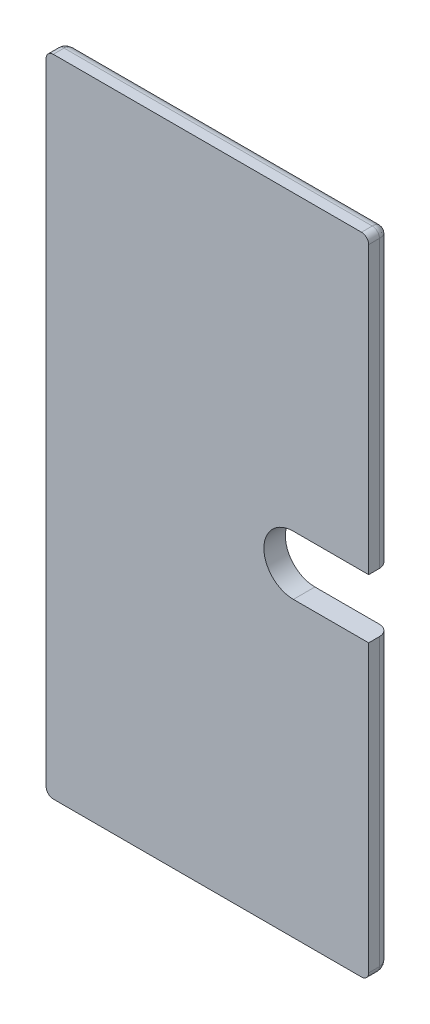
ISO-10303-21;
HEADER;
FILE_DESCRIPTION(('STEP AP214'),'2;1');
FILE_NAME('part.step','',(''),(''),'','','');
FILE_SCHEMA(('AUTOMOTIVE_DESIGN { 1 0 10303 214 1 1 1 1 }'));
ENDSEC;
DATA;
#1=APPLICATION_CONTEXT('core data for automotive mechanical design processes');
#2=APPLICATION_PROTOCOL_DEFINITION('international standard','automotive_design',2000,#1);
#3=PRODUCT_CONTEXT('',#1,'mechanical');
#4=PRODUCT('Part','Part','',(#3));
#5=PRODUCT_RELATED_PRODUCT_CATEGORY('part','',(#4));
#6=PRODUCT_DEFINITION_FORMATION('','',#4);
#7=PRODUCT_DEFINITION_CONTEXT('part definition',#1,'design');
#8=PRODUCT_DEFINITION('design','',#6,#7);
#9=PRODUCT_DEFINITION_SHAPE('','',#8);
#10=(LENGTH_UNIT() NAMED_UNIT(*) SI_UNIT(.MILLI.,.METRE.));
#11=(NAMED_UNIT(*) PLANE_ANGLE_UNIT() SI_UNIT($,.RADIAN.));
#12=(NAMED_UNIT(*) SI_UNIT($,.STERADIAN.) SOLID_ANGLE_UNIT());
#13=UNCERTAINTY_MEASURE_WITH_UNIT(LENGTH_MEASURE(1.E-05),#10,'distance_accuracy_value','');
#14=(GEOMETRIC_REPRESENTATION_CONTEXT(3) GLOBAL_UNCERTAINTY_ASSIGNED_CONTEXT((#13)) GLOBAL_UNIT_ASSIGNED_CONTEXT((#10,
#11,#12)) REPRESENTATION_CONTEXT('',''));
#15=CARTESIAN_POINT('',(0.,0.,0.));
#16=DIRECTION('',(0.,0.,1.));
#17=DIRECTION('',(1.,0.,0.));
#18=AXIS2_PLACEMENT_3D('',#15,#16,#17);
#19=CARTESIAN_POINT('',(22.5,44.,1.5));
#20=CARTESIAN_POINT('',(22.5,44.1495996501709,1.5));
#21=CARTESIAN_POINT('',(22.4486387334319,44.3738186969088,1.5));
#22=CARTESIAN_POINT('',(22.2883214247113,44.6286999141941,1.5));
#23=CARTESIAN_POINT('',(22.102148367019,44.8150622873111,1.5));
#24=CARTESIAN_POINT('',(21.8365622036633,44.9618750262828,1.5));
#25=CARTESIAN_POINT('',(21.6121997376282,45.,1.5));
#26=CARTESIAN_POINT('',(21.5,45.,1.5));
#27=CARTESIAN_POINT('',(22.5,44.,1.38780026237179));
#28=CARTESIAN_POINT('',(22.5,44.1495996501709,1.3765841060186));
#29=CARTESIAN_POINT('',(22.4486387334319,44.3738186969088,1.36367785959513));
#30=CARTESIAN_POINT('',(22.2883214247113,44.6286999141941,1.35659921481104));
#31=CARTESIAN_POINT('',(22.102148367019,44.8150622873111,1.3565890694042));
#32=CARTESIAN_POINT('',(21.8365622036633,44.9618750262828,1.36547389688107));
#33=CARTESIAN_POINT('',(21.6121997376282,45.,1.37940644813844));
#34=CARTESIAN_POINT('',(21.5,45.,1.38780026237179));
#35=CARTESIAN_POINT('',(22.4745884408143,43.9915294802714,1.1635417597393));
#36=CARTESIAN_POINT('',(22.469436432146,44.1352787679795,1.13007533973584));
#37=CARTESIAN_POINT('',(22.413444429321,44.350740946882,1.09154224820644));
#38=CARTESIAN_POINT('',(22.2537301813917,44.59759262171,1.07041027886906));
#39=CARTESIAN_POINT('',(22.0716155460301,44.7798699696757,1.07037891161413));
#40=CARTESIAN_POINT('',(21.8149292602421,44.9271409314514,1.09690475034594));
#41=CARTESIAN_POINT('',(21.5993388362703,44.9707115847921,1.13849238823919));
#42=CARTESIAN_POINT('',(21.4915294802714,44.9745884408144,1.16354175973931));
#43=CARTESIAN_POINT('',(22.325760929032,43.9419203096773,0.736971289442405));
#44=CARTESIAN_POINT('',(22.2962171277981,44.0557419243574,0.680636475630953));
#45=CARTESIAN_POINT('',(22.2204044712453,44.2264611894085,0.617015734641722));
#46=CARTESIAN_POINT('',(22.0673021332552,44.4308888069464,0.582385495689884));
#47=CARTESIAN_POINT('',(21.9081680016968,44.5901092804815,0.582347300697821));
#48=CARTESIAN_POINT('',(21.6980413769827,44.7358510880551,0.625770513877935));
#49=CARTESIAN_POINT('',(21.5273079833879,44.8036736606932,0.694783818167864));
#50=CARTESIAN_POINT('',(21.4419203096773,44.825760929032,0.736971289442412));
#51=CARTESIAN_POINT('',(22.0388414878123,43.8462804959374,0.377489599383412));
#52=CARTESIAN_POINT('',(21.9924894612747,43.922364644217,0.337545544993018));
#53=CARTESIAN_POINT('',(21.9109702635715,44.0365183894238,0.293818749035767));
#54=CARTESIAN_POINT('',(21.7838343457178,44.1810841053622,0.2703078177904));
#55=CARTESIAN_POINT('',(21.663958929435,44.3009851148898,0.270296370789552));
#56=CARTESIAN_POINT('',(21.5174948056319,44.4256109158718,0.299724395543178));
#57=CARTESIAN_POINT('',(21.4033603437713,44.504138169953,0.347547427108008));
#58=CARTESIAN_POINT('',(21.3462804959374,44.5388414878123,0.377489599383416));
#59=CARTESIAN_POINT('',(21.5605808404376,43.6868602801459,0.077179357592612));
#60=CARTESIAN_POINT('',(21.5254487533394,43.7226859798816,0.066454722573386));
#61=CARTESIAN_POINT('',(21.4725798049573,43.7764578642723,0.055007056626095));
#62=CARTESIAN_POINT('',(21.401462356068,43.8479729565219,0.048915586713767));
#63=CARTESIAN_POINT('',(21.3390555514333,43.9103956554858,0.048915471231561));
#64=CARTESIAN_POINT('',(21.267493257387,43.9814383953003,0.056528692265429));
#65=CARTESIAN_POINT('',(21.2137454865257,44.0342921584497,0.069131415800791));
#66=CARTESIAN_POINT('',(21.1868602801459,44.0605808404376,0.077179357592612));
#67=CARTESIAN_POINT('',(21.2243994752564,43.5747998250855,0.));
#68=CARTESIAN_POINT('',(21.2101518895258,43.589047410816,0.));
#69=CARTESIAN_POINT('',(21.18878051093,43.6104187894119,0.));
#70=CARTESIAN_POINT('',(21.1602853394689,43.638913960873,0.));
#71=CARTESIAN_POINT('',(21.1353520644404,43.6638472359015,0.));
#72=CARTESIAN_POINT('',(21.1068568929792,43.6923424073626,0.));
#73=CARTESIAN_POINT('',(21.0854855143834,43.7137137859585,0.));
#74=CARTESIAN_POINT('',(21.0747998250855,43.7243994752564,0.));
#75=CARTESIAN_POINT('',(21.,43.5,0.));
#76=CARTESIAN_POINT('',(21.,43.5,0.));
#77=CARTESIAN_POINT('',(21.,43.5,0.));
#78=CARTESIAN_POINT('',(21.,43.5,0.));
#79=CARTESIAN_POINT('',(21.,43.5,0.));
#80=CARTESIAN_POINT('',(21.,43.5,0.));
#81=CARTESIAN_POINT('',(21.,43.5,0.));
#82=CARTESIAN_POINT('',(21.,43.5,0.));
#83=B_SPLINE_SURFACE_WITH_KNOTS('',3,3,((#19,#20,#21,#22,#23,#24,#25,#26),(#27,#28,#29,#30,#31,
#32,#33,#34),(#35,#36,#37,#38,#39,#40,#41,#42),(#43,#44,#45,#46,#47,#48,#49,#50),(#51,#52,#53,
#54,#55,#56,#57,#58),(#59,#60,#61,#62,#63,#64,#65,#66),(#67,#68,#69,#70,#71,#72,#73,#74),(#75,
#76,#77,#78,#79,#80,#81,#82)),.UNSPECIFIED.,.F.,.F.,.F.,(4,1,1,1,1,4),(4,1,1,1,1,4),(0.,
0.224399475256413,0.448798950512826,0.897597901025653,1.12199737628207,1.57079632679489),(0.,
0.285714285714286,0.428571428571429,0.571428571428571,0.785714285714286,1.),.UNSPECIFIED.);
#84=CARTESIAN_POINT('',(21.,43.5,0.));
#85=CARTESIAN_POINT('',(21.0747998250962,43.7243994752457,0.));
#86=CARTESIAN_POINT('',(21.1868602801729,44.0605808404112,0.0771793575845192));
#87=CARTESIAN_POINT('',(21.3462804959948,44.5388414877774,0.377489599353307));
#88=CARTESIAN_POINT('',(21.4419203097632,44.8257609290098,0.73697128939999));
#89=CARTESIAN_POINT('',(21.4915294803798,44.9745884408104,1.16354175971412));
#90=CARTESIAN_POINT('',(21.5000000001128,45.,1.38780026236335));
#91=CARTESIAN_POINT('',(21.5000000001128,45.,1.5));
#92=B_SPLINE_CURVE_WITH_KNOTS('',3,(#84,#85,#86,#87,#88,#89,#90,#91),.UNSPECIFIED.,.F.,.F.,(4,1,
1,1,1,4),(0.,0.448798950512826,0.673198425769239,1.12199737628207,1.34639685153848,
1.57079632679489),.UNSPECIFIED.);
#93=CARTESIAN_POINT('',(21.5000000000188,45.,1.5));
#94=VERTEX_POINT('',#93);
#95=CARTESIAN_POINT('',(21.,43.5,0.));
#96=VERTEX_POINT('',#95);
#97=EDGE_CURVE('E164',#94,#96,#92,.F.);
#98=CARTESIAN_POINT('',(21.5,45.,1.5));
#99=CARTESIAN_POINT('',(21.5130898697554,45.0000000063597,1.5));
#100=CARTESIAN_POINT('',(21.5261796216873,44.9997405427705,1.5));
#101=CARTESIAN_POINT('',(21.5523386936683,44.9987060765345,1.5));
#102=CARTESIAN_POINT('',(21.5654080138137,44.9979310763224,1.5));
#103=CARTESIAN_POINT('',(21.5915062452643,44.9958689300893,1.5));
#104=CARTESIAN_POINT('',(21.6045351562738,44.9945817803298,1.5));
#105=CARTESIAN_POINT('',(21.6305326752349,44.9914987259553,1.5));
#106=CARTESIAN_POINT('',(21.6435012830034,44.9897028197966,1.5));
#107=CARTESIAN_POINT('',(21.6693582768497,44.9856056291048,1.5));
#108=CARTESIAN_POINT('',(21.6822466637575,44.98330434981,1.5));
#109=CARTESIAN_POINT('',(21.7079233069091,44.9781997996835,1.5));
#110=CARTESIAN_POINT('',(21.720711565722,44.975396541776,1.5));
#111=CARTESIAN_POINT('',(21.7461680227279,44.9692913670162,1.5));
#112=CARTESIAN_POINT('',(21.7588362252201,44.9659894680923,1.5));
#113=CARTESIAN_POINT('',(21.7840327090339,44.9588905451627,1.5));
#114=CARTESIAN_POINT('',(21.7965609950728,44.9550935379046,1.5));
#115=CARTESIAN_POINT('',(21.8214575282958,44.947007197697,1.5));
#116=CARTESIAN_POINT('',(21.8338257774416,44.9427178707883,1.5));
#117=CARTESIAN_POINT('',(21.858383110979,44.9336530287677,1.5));
#118=CARTESIAN_POINT('',(21.8705721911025,44.9288775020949,1.5));
#119=CARTESIAN_POINT('',(21.8947536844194,44.9188508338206,1.5));
#120=CARTESIAN_POINT('',(21.9067460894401,44.9135996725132,1.5));
#121=CARTESIAN_POINT('',(21.9305164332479,44.9026314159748,1.5));
#122=CARTESIAN_POINT('',(21.9422943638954,44.8969143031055,1.5));
#123=CARTESIAN_POINT('',(21.9656180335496,44.885024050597,1.5));
#124=CARTESIAN_POINT('',(21.9771637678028,44.8788509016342,1.5));
#125=CARTESIAN_POINT('',(22.0000052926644,44.8660584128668,1.5));
#126=CARTESIAN_POINT('',(22.0113010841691,44.8594390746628,1.5));
#127=CARTESIAN_POINT('',(22.0336249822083,44.8457640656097,1.5));
#128=CARTESIAN_POINT('',(22.0446530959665,44.838708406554,1.5));
#129=CARTESIAN_POINT('',(22.0664238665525,44.8241705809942,1.5));
#130=CARTESIAN_POINT('',(22.0771665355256,44.8166884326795,1.5));
#131=CARTESIAN_POINT('',(22.0983487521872,44.8013075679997,1.5));
#132=CARTESIAN_POINT('',(22.1087883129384,44.7934088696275,1.5));
#133=CARTESIAN_POINT('',(22.1293462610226,44.777204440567,1.5));
#134=CARTESIAN_POINT('',(22.139464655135,44.7688987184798,1.5));
#135=CARTESIAN_POINT('',(22.1593660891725,44.7518945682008,1.5));
#136=CARTESIAN_POINT('',(22.1691491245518,44.7431961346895,1.5));
#137=CARTESIAN_POINT('',(22.1883663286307,44.7254214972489,1.5));
#138=CARTESIAN_POINT('',(22.1978004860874,44.7163452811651,1.5));
#139=CARTESIAN_POINT('',(22.2163062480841,44.6978298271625,1.5));
#140=CARTESIAN_POINT('',(22.2253778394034,44.6883905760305,1.5));
#141=CARTESIAN_POINT('',(22.2431448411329,44.669163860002,1.5));
#142=CARTESIAN_POINT('',(22.251840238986,44.6593763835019,1.5));
#143=CARTESIAN_POINT('',(22.2688411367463,44.6394679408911,1.5));
#144=CARTESIAN_POINT('',(22.2771466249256,44.6293469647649,1.5));
#145=CARTESIAN_POINT('',(22.2933542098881,44.608786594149,1.5));
#146=CARTESIAN_POINT('',(22.3012562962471,44.598347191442,1.5));
#147=CARTESIAN_POINT('',(22.3166454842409,44.5771668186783,1.5));
#148=CARTESIAN_POINT('',(22.3241325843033,44.5664258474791,1.5));
#149=CARTESIAN_POINT('',(22.3386800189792,44.544659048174,1.5));
#150=CARTESIAN_POINT('',(22.3457403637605,44.5336332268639,1.5));
#151=CARTESIAN_POINT('',(22.3594224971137,44.5113134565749,1.5));
#152=CARTESIAN_POINT('',(22.3660443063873,44.5000195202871,1.5));
#153=CARTESIAN_POINT('',(22.3788377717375,44.4771803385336,1.5));
#154=CARTESIAN_POINT('',(22.3850094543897,44.4656351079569,1.5));
#155=CARTESIAN_POINT('',(22.3968903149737,44.4423097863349,1.5));
#156=CARTESIAN_POINT('',(22.4025995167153,44.4305297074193,1.5));
#157=CARTESIAN_POINT('',(22.4135464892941,44.4067527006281,1.5));
#158=CARTESIAN_POINT('',(22.4187842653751,44.3947557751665,1.5));
#159=CARTESIAN_POINT('',(22.4287842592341,44.3705649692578,1.5));
#160=CARTESIAN_POINT('',(22.4335464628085,44.3583710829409,1.5));
#161=CARTESIAN_POINT('',(22.4425902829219,44.3338057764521,1.5));
#162=CARTESIAN_POINT('',(22.4468718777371,44.3214343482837,1.5));
#163=CARTESIAN_POINT('',(22.4549496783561,44.2965334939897,1.5));
#164=CARTESIAN_POINT('',(22.4587458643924,44.2840040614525,1.5));
#165=CARTESIAN_POINT('',(22.4658479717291,44.2588066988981,1.5));
#166=CARTESIAN_POINT('',(22.4691538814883,44.2461387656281,1.5));
#167=CARTESIAN_POINT('',(22.4752705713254,44.2206839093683,1.5));
#168=CARTESIAN_POINT('',(22.4780813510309,44.207896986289,1.5));
#169=CARTESIAN_POINT('',(22.483202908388,44.1822236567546,1.5));
#170=CARTESIAN_POINT('',(22.4855136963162,44.1693372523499,1.5));
#171=CARTESIAN_POINT('',(22.4896303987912,44.1434844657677,1.5));
#172=CARTESIAN_POINT('',(22.4914363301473,44.1305180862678,1.5));
#173=CARTESIAN_POINT('',(22.4945384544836,44.1045248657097,1.5));
#174=CARTESIAN_POINT('',(22.495834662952,44.0914980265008,1.5));
#175=CARTESIAN_POINT('',(22.497912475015,44.065403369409,1.5));
#176=CARTESIAN_POINT('',(22.4986940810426,44.05233555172,1.5));
#177=CARTESIAN_POINT('',(22.4997378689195,44.026178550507,1.5));
#178=CARTESIAN_POINT('',(22.500000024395,44.0130893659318,1.5));
#179=CARTESIAN_POINT('',(22.5,44.,1.5));
#180=B_SPLINE_CURVE_WITH_KNOTS('',3,(#98,#99,#100,#101,#102,#103,#104,#105,#106,#107,#108,#109,
#110,#111,#112,#113,#114,#115,#116,#117,#118,#119,#120,#121,#122,#123,#124,#125,#126,#127,#128,
#129,#130,#131,#132,#133,#134,#135,#136,#137,#138,#139,#140,#141,#142,#143,#144,#145,#146,#147,
#148,#149,#150,#151,#152,#153,#154,#155,#156,#157,#158,#159,#160,#161,#162,#163,#164,#165,#166,
#167,#168,#169,#170,#171,#172,#173,#174,#175,#176,#177,#178,#179),.UNSPECIFIED.,.F.,.F.,(4,2,2,
2,2,2,2,2,2,2,2,2,2,2,2,2,2,2,2,2,2,2,2,2,2,2,2,2,2,2,2,2,2,2,2,2,2,2,2,2,4),(0.,
0.0392668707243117,0.0785335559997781,0.117800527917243,0.157067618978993,0.196334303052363,
0.23559997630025,0.274864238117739,0.314127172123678,0.353389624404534,0.39265301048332,
0.431918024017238,0.471184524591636,0.510451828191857,0.549718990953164,0.588985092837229,
0.628249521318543,0.667512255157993,0.706774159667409,0.746036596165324,0.785300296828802,
0.824565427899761,0.863831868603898,0.903099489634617,0.942368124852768,0.981636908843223,
1.02090475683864,1.06017074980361,1.09943442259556,1.13869607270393,1.17795728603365,
1.21721967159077,1.25648383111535,1.29574958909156,1.33501627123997,1.37428298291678,
1.41354888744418,1.45281348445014,1.49207688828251,1.53134010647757,1.57060531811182),.UNSPECIFIED.);
#181=CARTESIAN_POINT('',(22.5,44.,1.5));
#182=VERTEX_POINT('',#181);
#183=EDGE_CURVE('E148',#94,#182,#180,.T.);
#184=CARTESIAN_POINT('',(22.5,44.,1.5));
#185=CARTESIAN_POINT('',(22.5000001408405,44.0000000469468,1.48036618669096));
#186=CARTESIAN_POINT('',(22.4996109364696,43.9998703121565,1.46073257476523));
#187=CARTESIAN_POINT('',(22.4980592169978,43.9993530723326,1.42149831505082));
#188=CARTESIAN_POINT('',(22.4968966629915,43.9989655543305,1.40189766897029));
#189=CARTESIAN_POINT('',(22.4938031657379,43.9979343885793,1.36275807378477));
#190=CARTESIAN_POINT('',(22.4918719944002,43.9972906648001,1.34321914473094));
#191=CARTESIAN_POINT('',(22.4872463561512,43.9957487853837,1.30423155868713));
#192=CARTESIAN_POINT('',(22.4845514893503,43.9948504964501,1.28478295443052));
#193=CARTESIAN_POINT('',(22.4784035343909,43.9928011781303,1.24600460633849));
#194=CARTESIAN_POINT('',(22.4749498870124,43.9916499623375,1.22667496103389));
#195=CARTESIAN_POINT('',(22.4672892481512,43.9890964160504,1.18816315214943));
#196=CARTESIAN_POINT('',(22.4630815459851,43.9876938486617,1.16898114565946));
#197=CARTESIAN_POINT('',(22.4539186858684,43.9846395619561,1.13079391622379));
#198=CARTESIAN_POINT('',(22.4489627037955,43.9829875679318,1.1117889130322));
#199=CARTESIAN_POINT('',(22.4383115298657,43.9794371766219,1.0739859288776));
#200=CARTESIAN_POINT('',(22.4326154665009,43.9775384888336,1.05518822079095));
#201=CARTESIAN_POINT('',(22.4204920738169,43.973497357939,1.01783027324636));
#202=CARTESIAN_POINT('',(22.4140638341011,43.971354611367,0.999270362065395));
#203=CARTESIAN_POINT('',(22.4004840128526,43.9668280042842,0.962418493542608));
#204=CARTESIAN_POINT('',(22.3933314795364,43.9644438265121,0.944126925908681));
#205=CARTESIAN_POINT('',(22.3783113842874,43.9594371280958,0.907841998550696));
#206=CARTESIAN_POINT('',(22.3704428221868,43.9568142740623,0.88984909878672));
#207=CARTESIAN_POINT('',(22.3539974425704,43.9513324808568,0.854192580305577));
#208=CARTESIAN_POINT('',(22.3454195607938,43.9484731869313,0.836529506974));
#209=CARTESIAN_POINT('',(22.3275701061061,43.9425233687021,0.801559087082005));
#210=CARTESIAN_POINT('',(22.3182973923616,43.9394324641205,0.784252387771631));
#211=CARTESIAN_POINT('',(22.2990783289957,43.9330261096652,0.750017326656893));
#212=CARTESIAN_POINT('',(22.2891307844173,43.9297102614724,0.733089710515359));
#213=CARTESIAN_POINT('',(22.2685807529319,43.9228602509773,0.699636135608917));
#214=CARTESIAN_POINT('',(22.2579770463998,43.9193256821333,0.683111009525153));
#215=CARTESIAN_POINT('',(22.2361337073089,43.912044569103,0.650485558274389));
#216=CARTESIAN_POINT('',(22.2248928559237,43.9082976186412,0.634386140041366));
#217=CARTESIAN_POINT('',(22.2017941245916,43.9005980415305,0.602635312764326));
#218=CARTESIAN_POINT('',(22.1899350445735,43.8966450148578,0.586984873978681));
#219=CARTESIAN_POINT('',(22.1656187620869,43.8885395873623,0.556155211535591));
#220=CARTESIAN_POINT('',(22.1531603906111,43.8843867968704,0.540977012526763));
#221=CARTESIAN_POINT('',(22.1276644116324,43.8758881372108,0.511115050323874));
#222=CARTESIAN_POINT('',(22.114625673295,43.8715418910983,0.49643236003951));
#223=CARTESIAN_POINT('',(22.0879878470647,43.8626626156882,0.467584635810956));
#224=CARTESIAN_POINT('',(22.0743876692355,43.8581292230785,0.453420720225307));
#225=CARTESIAN_POINT('',(22.0466458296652,43.8488819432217,0.425633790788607));
#226=CARTESIAN_POINT('',(22.0325031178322,43.8441677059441,0.412011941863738));
#227=CARTESIAN_POINT('',(22.0036951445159,43.834565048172,0.385332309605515));
#228=CARTESIAN_POINT('',(21.9890288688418,43.8296762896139,0.37227574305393));
#229=CARTESIAN_POINT('',(21.959192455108,43.8197308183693,0.346750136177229));
#230=CARTESIAN_POINT('',(21.9440213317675,43.8146737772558,0.334282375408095));
#231=CARTESIAN_POINT('',(21.913195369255,43.8043984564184,0.309957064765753));
#232=CARTESIAN_POINT('',(21.8975395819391,43.7991798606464,0.298100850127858));
#233=CARTESIAN_POINT('',(21.8657713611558,43.7885904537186,0.275014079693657));
#234=CARTESIAN_POINT('',(21.8496580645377,43.7832193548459,0.263784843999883));
#235=CARTESIAN_POINT('',(21.8170014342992,43.7723338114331,0.24196835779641));
#236=CARTESIAN_POINT('',(21.8004573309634,43.7668191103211,0.231382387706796));
#237=CARTESIAN_POINT('',(21.7669658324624,43.7556552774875,0.210868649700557));
#238=CARTESIAN_POINT('',(21.7500177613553,43.7500059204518,0.200942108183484));
#239=CARTESIAN_POINT('',(21.7157451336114,43.7385817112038,0.18176326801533));
#240=CARTESIAN_POINT('',(21.698419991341,43.7328066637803,0.172512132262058));
#241=CARTESIAN_POINT('',(21.663419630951,43.7211398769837,0.154701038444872));
#242=CARTESIAN_POINT('',(21.6457439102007,43.7152479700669,0.14614217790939));
#243=CARTESIAN_POINT('',(21.6100700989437,43.7033566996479,0.12972834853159));
#244=CARTESIAN_POINT('',(21.5920715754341,43.6973571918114,0.121874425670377));
#245=CARTESIAN_POINT('',(21.5557814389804,43.6852604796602,0.1068772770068));
#246=CARTESIAN_POINT('',(21.5374894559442,43.6791631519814,0.0997350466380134));
#247=CARTESIAN_POINT('',(21.5006411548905,43.6668803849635,0.086169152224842));
#248=CARTESIAN_POINT('',(21.4820845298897,43.6606948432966,0.0797464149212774));
#249=CARTESIAN_POINT('',(21.4447358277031,43.648245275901,0.0676271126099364));
#250=CARTESIAN_POINT('',(21.4259435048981,43.6419811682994,0.0619313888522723));
#251=CARTESIAN_POINT('',(21.3881522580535,43.6293840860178,0.0512738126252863));
#252=CARTESIAN_POINT('',(21.369153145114,43.6230510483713,0.0463127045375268));
#253=CARTESIAN_POINT('',(21.3309771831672,43.6103257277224,0.0371320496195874));
#254=CARTESIAN_POINT('',(21.3118001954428,43.6039333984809,0.0329131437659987));
#255=CARTESIAN_POINT('',(21.2732973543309,43.5910991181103,0.0252245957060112));
#256=CARTESIAN_POINT('',(21.2539714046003,43.5846571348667,0.0217554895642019));
#257=CARTESIAN_POINT('',(21.2151995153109,43.5717331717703,0.0155742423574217));
#258=CARTESIAN_POINT('',(21.1957535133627,43.5652511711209,0.0128625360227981));
#259=CARTESIAN_POINT('',(21.1567704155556,43.5522568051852,0.00820379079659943));
#260=CARTESIAN_POINT('',(21.1372332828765,43.5457444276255,0.0062570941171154));
#261=CARTESIAN_POINT('',(21.0980967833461,43.532698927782,0.00313604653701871));
#262=CARTESIAN_POINT('',(21.0784973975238,43.5261657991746,0.0019619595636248));
#263=CARTESIAN_POINT('',(21.0392654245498,43.5130884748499,0.00039385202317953));
#264=CARTESIAN_POINT('',(21.0196328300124,43.5065442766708,3.70119876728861E-08));
#265=CARTESIAN_POINT('',(21.,43.5,0.));
#266=B_SPLINE_CURVE_WITH_KNOTS('',3,(#184,#185,#186,#187,#188,#189,#190,#191,#192,#193,#194,
#195,#196,#197,#198,#199,#200,#201,#202,#203,#204,#205,#206,#207,#208,#209,#210,#211,#212,#213,
#214,#215,#216,#217,#218,#219,#220,#221,#222,#223,#224,#225,#226,#227,#228,#229,#230,#231,#232,
#233,#234,#235,#236,#237,#238,#239,#240,#241,#242,#243,#244,#245,#246,#247,#248,#249,#250,#251,
#252,#253,#254,#255,#256,#257,#258,#259,#260,#261,#262,#263,#264,#265),.UNSPECIFIED.,.F.,.F.,(4,
2,2,2,2,2,2,2,2,2,2,2,2,2,2,2,2,2,2,2,2,2,2,2,2,2,2,2,2,2,2,2,2,2,2,2,2,2,2,2,4),(0.,
0.058896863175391,0.117796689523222,0.176714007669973,0.235662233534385,0.294654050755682,
0.353701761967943,0.412814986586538,0.471998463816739,0.5312563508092,0.590593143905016,
0.650014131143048,0.709525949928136,0.769137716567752,0.82885794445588,0.888692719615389,
0.948646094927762,1.00872052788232,1.06891731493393,1.12923702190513,1.18967991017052,
1.250246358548,1.3109372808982,1.37175453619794,1.43269939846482,1.49376808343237,
1.55495459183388,1.61625188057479,1.6776523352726,1.73914829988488,1.80073405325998,
1.86240477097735,1.92415403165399,1.98597410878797,2.04785640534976,2.10979188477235,
2.17177149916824,2.23378661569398,2.29582944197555,2.35789345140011,2.41997380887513),.UNSPECIFIED.);
#267=EDGE_CURVE('E322',#96,#182,#266,.F.);
#268=ORIENTED_EDGE('',*,*,#97,.F.);
#269=ORIENTED_EDGE('',*,*,#183,.T.);
#270=ORIENTED_EDGE('',*,*,#267,.F.);
#271=EDGE_LOOP('',(#268,#269,#270));
#272=FACE_BOUND('',#271,.T.);
#273=ADVANCED_FACE('F16',(#272),#83,.T.);
#274=CARTESIAN_POINT('',(-21.5,45.,1.5));
#275=CARTESIAN_POINT('',(-21.6495996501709,45.,1.5));
#276=CARTESIAN_POINT('',(-21.8738186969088,44.9486387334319,1.5));
#277=CARTESIAN_POINT('',(-22.1286999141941,44.7883214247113,1.5));
#278=CARTESIAN_POINT('',(-22.3150622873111,44.602148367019,1.5));
#279=CARTESIAN_POINT('',(-22.4618750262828,44.3365622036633,1.5));
#280=CARTESIAN_POINT('',(-22.5,44.1121997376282,1.5));
#281=CARTESIAN_POINT('',(-22.5,44.,1.5));
#282=CARTESIAN_POINT('',(-21.5,45.,1.38780026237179));
#283=CARTESIAN_POINT('',(-21.6495996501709,45.,1.3765841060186));
#284=CARTESIAN_POINT('',(-21.8738186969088,44.9486387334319,1.36367785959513));
#285=CARTESIAN_POINT('',(-22.1286999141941,44.7883214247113,1.35659921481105));
#286=CARTESIAN_POINT('',(-22.3150622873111,44.602148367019,1.3565890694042));
#287=CARTESIAN_POINT('',(-22.4618750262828,44.3365622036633,1.36547389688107));
#288=CARTESIAN_POINT('',(-22.5,44.1121997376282,1.37940644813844));
#289=CARTESIAN_POINT('',(-22.5,44.,1.38780026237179));
#290=CARTESIAN_POINT('',(-21.4915873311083,44.9747619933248,1.16338370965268));
#291=CARTESIAN_POINT('',(-21.6351543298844,44.969287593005,1.12990052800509));
#292=CARTESIAN_POINT('',(-21.8503425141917,44.9129510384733,1.09140205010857));
#293=CARTESIAN_POINT('',(-22.0969939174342,44.7530973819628,1.07030167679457));
#294=CARTESIAN_POINT('',(-22.2792299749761,44.5710223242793,1.07027075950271));
#295=CARTESIAN_POINT('',(-22.4266897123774,44.3145760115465,1.09675512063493));
#296=CARTESIAN_POINT('',(-22.4706410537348,44.0992592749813,1.13831989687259));
#297=CARTESIAN_POINT('',(-22.4747619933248,43.9915873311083,1.16338370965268));
#298=CARTESIAN_POINT('',(-21.4542722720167,44.8628168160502,0.843752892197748));
#299=CARTESIAN_POINT('',(-21.5757425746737,44.8396615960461,0.793173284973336));
#300=CARTESIAN_POINT('',(-21.7578957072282,44.7691086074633,0.735820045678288));
#301=CARTESIAN_POINT('',(-21.9731092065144,44.6144834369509,0.704552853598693));
#302=CARTESIAN_POINT('',(-22.1381288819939,44.4495697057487,0.704515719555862));
#303=CARTESIAN_POINT('',(-22.2840790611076,44.2275872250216,0.743730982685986));
#304=CARTESIAN_POINT('',(-22.3454981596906,44.0453899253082,0.805878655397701));
#305=CARTESIAN_POINT('',(-22.3628168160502,43.9542722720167,0.843752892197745));
#306=CARTESIAN_POINT('',(-21.3742564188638,44.6227692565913,0.46114030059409));
#307=CARTESIAN_POINT('',(-21.4596880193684,44.5786691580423,0.413716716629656));
#308=CARTESIAN_POINT('',(-21.5878722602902,44.4960532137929,0.361354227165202));
#309=CARTESIAN_POINT('',(-21.7480550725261,44.3602424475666,0.33310643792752));
#310=CARTESIAN_POINT('',(-21.8789785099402,44.2293577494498,0.333087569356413));
#311=CARTESIAN_POINT('',(-22.011278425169,44.0665124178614,0.368462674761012));
#312=CARTESIAN_POINT('',(-22.089778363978,43.9383537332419,0.425600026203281));
#313=CARTESIAN_POINT('',(-22.1227692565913,43.8742564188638,0.461140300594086));
#314=CARTESIAN_POINT('',(-21.224383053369,44.1731491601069,0.102456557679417));
#315=CARTESIAN_POINT('',(-21.2669279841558,44.1301646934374,0.088221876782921));
#316=CARTESIAN_POINT('',(-21.3307833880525,44.0658665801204,0.073209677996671));
#317=CARTESIAN_POINT('',(-21.4161010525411,43.9801943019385,0.065260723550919));
#318=CARTESIAN_POINT('',(-21.4908951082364,43.9054155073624,0.065262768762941));
#319=CARTESIAN_POINT('',(-21.5765989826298,43.8201368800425,0.075189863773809));
#320=CARTESIAN_POINT('',(-21.6409777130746,43.7563091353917,0.091771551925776));
#321=CARTESIAN_POINT('',(-21.6731491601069,43.724383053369,0.102456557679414));
#322=CARTESIAN_POINT('',(-21.0747998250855,43.7243994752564,0.));
#323=CARTESIAN_POINT('',(-21.089047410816,43.7101518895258,0.));
#324=CARTESIAN_POINT('',(-21.1104187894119,43.68878051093,0.));
#325=CARTESIAN_POINT('',(-21.138913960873,43.6602853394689,0.));
#326=CARTESIAN_POINT('',(-21.1638472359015,43.6353520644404,0.));
#327=CARTESIAN_POINT('',(-21.1923424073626,43.6068568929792,0.));
#328=CARTESIAN_POINT('',(-21.2137137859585,43.5854855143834,0.));
#329=CARTESIAN_POINT('',(-21.2243994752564,43.5747998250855,0.));
#330=CARTESIAN_POINT('',(-21.,43.5,0.));
#331=CARTESIAN_POINT('',(-21.,43.5,0.));
#332=CARTESIAN_POINT('',(-21.,43.5,0.));
#333=CARTESIAN_POINT('',(-21.,43.5,0.));
#334=CARTESIAN_POINT('',(-21.,43.5,0.));
#335=CARTESIAN_POINT('',(-21.,43.5,0.));
#336=CARTESIAN_POINT('',(-21.,43.5,0.));
#337=CARTESIAN_POINT('',(-21.,43.5,0.));
#338=B_SPLINE_SURFACE_WITH_KNOTS('',3,3,((#274,#275,#276,#277,#278,#279,#280,#281),(#282,#283,
#284,#285,#286,#287,#288,#289),(#290,#291,#292,#293,#294,#295,#296,#297),(#298,#299,#300,#301,
#302,#303,#304,#305),(#306,#307,#308,#309,#310,#311,#312,#313),(#314,#315,#316,#317,#318,#319,
#320,#321),(#322,#323,#324,#325,#326,#327,#328,#329),(#330,#331,#332,#333,#334,#335,#336,#337)),
.UNSPECIFIED.,.F.,.F.,.F.,(4,1,1,1,1,4),(4,1,1,1,1,4),(0.,0.224399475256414,0.448798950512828,
0.673198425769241,1.12199737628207,1.5707963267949),(0.,0.285714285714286,0.428571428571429,
0.571428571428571,0.785714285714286,1.),.UNSPECIFIED.);
#339=CARTESIAN_POINT('',(-21.,43.5,0.));
#340=CARTESIAN_POINT('',(-21.2243994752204,43.5747998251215,0.));
#341=CARTESIAN_POINT('',(-21.6731491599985,43.7243830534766,0.10245655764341));
#342=CARTESIAN_POINT('',(-22.1227692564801,43.8742564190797,0.461140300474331));
#343=CARTESIAN_POINT('',(-22.3628168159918,43.9542722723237,0.843752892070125));
#344=CARTESIAN_POINT('',(-22.4747619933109,43.9915873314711,1.16338370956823));
#345=CARTESIAN_POINT('',(-22.5,44.0000000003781,1.38780026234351));
#346=CARTESIAN_POINT('',(-22.5,44.0000000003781,1.5));
#347=B_SPLINE_CURVE_WITH_KNOTS('',3,(#339,#340,#341,#342,#343,#344,#345,#346),.UNSPECIFIED.,.F.,
.F.,(4,1,1,1,1,4),(0.,0.448798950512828,0.897597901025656,1.12199737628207,1.34639685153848,
1.5707963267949),.UNSPECIFIED.);
#348=CARTESIAN_POINT('',(-22.5,44.000000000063,1.5));
#349=VERTEX_POINT('',#348);
#350=CARTESIAN_POINT('',(-21.,43.5,0.));
#351=VERTEX_POINT('',#350);
#352=EDGE_CURVE('E152',#349,#351,#347,.F.);
#353=CARTESIAN_POINT('',(-22.5,44.,1.5));
#354=CARTESIAN_POINT('',(-22.5000000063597,44.0130898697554,1.5));
#355=CARTESIAN_POINT('',(-22.4997405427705,44.0261796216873,1.5));
#356=CARTESIAN_POINT('',(-22.4987060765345,44.0523386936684,1.5));
#357=CARTESIAN_POINT('',(-22.4979310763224,44.0654080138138,1.5));
#358=CARTESIAN_POINT('',(-22.4958689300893,44.0915062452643,1.5));
#359=CARTESIAN_POINT('',(-22.4945817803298,44.1045351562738,1.5));
#360=CARTESIAN_POINT('',(-22.4914987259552,44.1305326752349,1.5));
#361=CARTESIAN_POINT('',(-22.4897028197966,44.1435012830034,1.5));
#362=CARTESIAN_POINT('',(-22.4856056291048,44.1693582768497,1.5));
#363=CARTESIAN_POINT('',(-22.48330434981,44.1822466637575,1.5));
#364=CARTESIAN_POINT('',(-22.4781997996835,44.2079233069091,1.5));
#365=CARTESIAN_POINT('',(-22.475396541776,44.220711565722,1.5));
#366=CARTESIAN_POINT('',(-22.4692913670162,44.2461680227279,1.5));
#367=CARTESIAN_POINT('',(-22.4659894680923,44.2588362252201,1.5));
#368=CARTESIAN_POINT('',(-22.4588905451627,44.2840327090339,1.5));
#369=CARTESIAN_POINT('',(-22.4550935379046,44.2965609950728,1.5));
#370=CARTESIAN_POINT('',(-22.447007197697,44.3214575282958,1.5));
#371=CARTESIAN_POINT('',(-22.4427178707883,44.3338257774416,1.5));
#372=CARTESIAN_POINT('',(-22.4336530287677,44.3583831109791,1.5));
#373=CARTESIAN_POINT('',(-22.4288775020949,44.3705721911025,1.5));
#374=CARTESIAN_POINT('',(-22.4188508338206,44.3947536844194,1.5));
#375=CARTESIAN_POINT('',(-22.4135996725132,44.4067460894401,1.5));
#376=CARTESIAN_POINT('',(-22.4026314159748,44.4305164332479,1.5));
#377=CARTESIAN_POINT('',(-22.3969143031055,44.4422943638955,1.5));
#378=CARTESIAN_POINT('',(-22.385024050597,44.4656180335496,1.5));
#379=CARTESIAN_POINT('',(-22.3788509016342,44.4771637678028,1.5));
#380=CARTESIAN_POINT('',(-22.3660584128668,44.5000052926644,1.5));
#381=CARTESIAN_POINT('',(-22.3594390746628,44.5113010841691,1.5));
#382=CARTESIAN_POINT('',(-22.3457640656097,44.5336249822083,1.5));
#383=CARTESIAN_POINT('',(-22.338708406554,44.5446530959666,1.5));
#384=CARTESIAN_POINT('',(-22.3241705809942,44.5664238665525,1.5));
#385=CARTESIAN_POINT('',(-22.3166884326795,44.5771665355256,1.5));
#386=CARTESIAN_POINT('',(-22.3013075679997,44.5983487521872,1.5));
#387=CARTESIAN_POINT('',(-22.2934088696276,44.6087883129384,1.5));
#388=CARTESIAN_POINT('',(-22.277204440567,44.6293462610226,1.5));
#389=CARTESIAN_POINT('',(-22.2688987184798,44.639464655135,1.5));
#390=CARTESIAN_POINT('',(-22.2518945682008,44.6593660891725,1.5));
#391=CARTESIAN_POINT('',(-22.2431961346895,44.6691491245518,1.5));
#392=CARTESIAN_POINT('',(-22.2254214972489,44.6883663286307,1.5));
#393=CARTESIAN_POINT('',(-22.2163452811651,44.6978004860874,1.5));
#394=CARTESIAN_POINT('',(-22.1978298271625,44.7163062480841,1.5));
#395=CARTESIAN_POINT('',(-22.1883905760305,44.7253778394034,1.5));
#396=CARTESIAN_POINT('',(-22.169163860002,44.7431448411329,1.5));
#397=CARTESIAN_POINT('',(-22.1593763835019,44.751840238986,1.5));
#398=CARTESIAN_POINT('',(-22.1394679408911,44.7688411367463,1.5));
#399=CARTESIAN_POINT('',(-22.1293469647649,44.7771466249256,1.5));
#400=CARTESIAN_POINT('',(-22.1087865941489,44.7933542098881,1.5));
#401=CARTESIAN_POINT('',(-22.098347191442,44.8012562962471,1.5));
#402=CARTESIAN_POINT('',(-22.0771668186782,44.8166454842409,1.5));
#403=CARTESIAN_POINT('',(-22.0664258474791,44.8241325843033,1.5));
#404=CARTESIAN_POINT('',(-22.044659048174,44.8386800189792,1.5));
#405=CARTESIAN_POINT('',(-22.0336332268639,44.8457403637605,1.5));
#406=CARTESIAN_POINT('',(-22.0113134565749,44.8594224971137,1.5));
#407=CARTESIAN_POINT('',(-22.0000195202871,44.8660443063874,1.5));
#408=CARTESIAN_POINT('',(-21.9771803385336,44.8788377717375,1.5));
#409=CARTESIAN_POINT('',(-21.9656351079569,44.8850094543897,1.5));
#410=CARTESIAN_POINT('',(-21.9423097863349,44.8968903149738,1.5));
#411=CARTESIAN_POINT('',(-21.9305297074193,44.9025995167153,1.5));
#412=CARTESIAN_POINT('',(-21.9067527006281,44.9135464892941,1.5));
#413=CARTESIAN_POINT('',(-21.8947557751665,44.9187842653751,1.5));
#414=CARTESIAN_POINT('',(-21.8705649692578,44.9287842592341,1.5));
#415=CARTESIAN_POINT('',(-21.8583710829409,44.9335464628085,1.5));
#416=CARTESIAN_POINT('',(-21.8338057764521,44.9425902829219,1.5));
#417=CARTESIAN_POINT('',(-21.8214343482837,44.9468718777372,1.5));
#418=CARTESIAN_POINT('',(-21.7965334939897,44.9549496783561,1.5));
#419=CARTESIAN_POINT('',(-21.7840040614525,44.9587458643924,1.5));
#420=CARTESIAN_POINT('',(-21.7588066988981,44.9658479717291,1.5));
#421=CARTESIAN_POINT('',(-21.7461387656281,44.9691538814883,1.5));
#422=CARTESIAN_POINT('',(-21.7206839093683,44.9752705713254,1.5));
#423=CARTESIAN_POINT('',(-21.707896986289,44.9780813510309,1.5));
#424=CARTESIAN_POINT('',(-21.6822236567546,44.9832029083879,1.5));
#425=CARTESIAN_POINT('',(-21.6693372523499,44.9855136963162,1.5));
#426=CARTESIAN_POINT('',(-21.6434844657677,44.9896303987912,1.5));
#427=CARTESIAN_POINT('',(-21.6305180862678,44.9914363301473,1.5));
#428=CARTESIAN_POINT('',(-21.6045248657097,44.9945384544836,1.5));
#429=CARTESIAN_POINT('',(-21.5914980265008,44.995834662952,1.5));
#430=CARTESIAN_POINT('',(-21.565403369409,44.997912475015,1.5));
#431=CARTESIAN_POINT('',(-21.5523355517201,44.9986940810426,1.5));
#432=CARTESIAN_POINT('',(-21.526178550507,44.9997378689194,1.5));
#433=CARTESIAN_POINT('',(-21.5130893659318,45.000000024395,1.5));
#434=CARTESIAN_POINT('',(-21.5,45.,1.5));
#435=B_SPLINE_CURVE_WITH_KNOTS('',3,(#353,#354,#355,#356,#357,#358,#359,#360,#361,#362,#363,
#364,#365,#366,#367,#368,#369,#370,#371,#372,#373,#374,#375,#376,#377,#378,#379,#380,#381,#382,
#383,#384,#385,#386,#387,#388,#389,#390,#391,#392,#393,#394,#395,#396,#397,#398,#399,#400,#401,
#402,#403,#404,#405,#406,#407,#408,#409,#410,#411,#412,#413,#414,#415,#416,#417,#418,#419,#420,
#421,#422,#423,#424,#425,#426,#427,#428,#429,#430,#431,#432,#433,#434),.UNSPECIFIED.,.F.,.F.,(4,
2,2,2,2,2,2,2,2,2,2,2,2,2,2,2,2,2,2,2,2,2,2,2,2,2,2,2,2,2,2,2,2,2,2,2,2,2,2,2,4),(0.,
0.0392668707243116,0.0785335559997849,0.11780052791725,0.157067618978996,0.196334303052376,
0.235599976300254,0.274864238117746,0.314127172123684,0.353389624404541,0.392653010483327,
0.431918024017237,0.471184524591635,0.510451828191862,0.549718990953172,0.588985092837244,
0.628249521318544,0.66751225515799,0.706774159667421,0.746036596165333,0.785300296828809,
0.824565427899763,0.863831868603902,0.903099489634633,0.942368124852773,0.98163690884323,
1.02090475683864,1.06017074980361,1.09943442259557,1.13869607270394,1.17795728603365,
1.21721967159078,1.25648383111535,1.29574958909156,1.33501627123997,1.37428298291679,
1.41354888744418,1.45281348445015,1.4920768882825,1.53134010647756,1.57060531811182),.UNSPECIFIED.);
#436=CARTESIAN_POINT('',(-21.5,45.,1.5));
#437=VERTEX_POINT('',#436);
#438=EDGE_CURVE('E135',#349,#437,#435,.T.);
#439=CARTESIAN_POINT('',(-21.5,45.,1.5));
#440=CARTESIAN_POINT('',(-21.5000000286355,45.0000000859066,1.48036418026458));
#441=CARTESIAN_POINT('',(-21.499871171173,44.9996135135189,1.46072847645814));
#442=CARTESIAN_POINT('',(-21.4993568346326,44.9980705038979,1.42148698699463));
#443=CARTESIAN_POINT('',(-21.4989713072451,44.9969139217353,1.40188120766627));
#444=CARTESIAN_POINT('',(-21.4979446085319,44.9938338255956,1.36273004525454));
#445=CARTESIAN_POINT('',(-21.4973033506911,44.9919100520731,1.34318468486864));
#446=CARTESIAN_POINT('',(-21.4957661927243,44.9872985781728,1.30418475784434));
#447=CARTESIAN_POINT('',(-21.4948701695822,44.9846105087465,1.28473023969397));
#448=CARTESIAN_POINT('',(-21.4928245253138,44.9784735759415,1.24594237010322));
#449=CARTESIAN_POINT('',(-21.4916747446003,44.9750242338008,1.22660910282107));
#450=CARTESIAN_POINT('',(-21.4891224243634,44.96736727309,1.18809423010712));
#451=CARTESIAN_POINT('',(-21.4877196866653,44.963159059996,1.16891275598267));
#452=CARTESIAN_POINT('',(-21.4846631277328,44.9539893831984,1.13073133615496));
#453=CARTESIAN_POINT('',(-21.4830090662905,44.9490271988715,1.11173158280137));
#454=CARTESIAN_POINT('',(-21.4794537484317,44.9383612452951,1.07394138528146));
#455=CARTESIAN_POINT('',(-21.4775522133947,44.9326566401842,1.05515120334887));
#456=CARTESIAN_POINT('',(-21.4735054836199,44.9205164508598,1.01780810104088));
#457=CARTESIAN_POINT('',(-21.4713599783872,44.9140799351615,0.999255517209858));
#458=CARTESIAN_POINT('',(-21.46682891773,44.9004867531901,0.962415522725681));
#459=CARTESIAN_POINT('',(-21.4644430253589,44.8933290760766,0.94412852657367));
#460=CARTESIAN_POINT('',(-21.459434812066,44.878304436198,0.907847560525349));
#461=CARTESIAN_POINT('',(-21.4568121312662,44.8704363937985,0.889854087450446));
#462=CARTESIAN_POINT('',(-21.4513338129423,44.854001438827,0.854188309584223));
#463=CARTESIAN_POINT('',(-21.4484777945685,44.8454333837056,0.836516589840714));
#464=CARTESIAN_POINT('',(-21.4425371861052,44.8276115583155,0.80152171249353));
#465=CARTESIAN_POINT('',(-21.4394522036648,44.8183566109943,0.784199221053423));
#466=CARTESIAN_POINT('',(-21.4330586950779,44.7991760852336,0.749929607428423));
#467=CARTESIAN_POINT('',(-21.429749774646,44.7892493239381,0.732983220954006));
#468=CARTESIAN_POINT('',(-21.4229132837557,44.768739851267,0.699492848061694));
#469=CARTESIAN_POINT('',(-21.4193853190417,44.7581559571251,0.68294966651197));
#470=CARTESIAN_POINT('',(-21.4121156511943,44.736346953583,0.650292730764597));
#471=CARTESIAN_POINT('',(-21.408373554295,44.725120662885,0.634179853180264));
#472=CARTESIAN_POINT('',(-21.400680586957,44.7020417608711,0.602410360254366));
#473=CARTESIAN_POINT('',(-21.3967293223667,44.6901879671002,0.58675469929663));
#474=CARTESIAN_POINT('',(-21.388622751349,44.665868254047,0.555927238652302));
#475=CARTESIAN_POINT('',(-21.3844670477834,44.6534011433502,0.540756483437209));
#476=CARTESIAN_POINT('',(-21.3759591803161,44.6278775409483,0.510918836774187));
#477=CARTESIAN_POINT('',(-21.3716066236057,44.6148198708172,0.496253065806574));
#478=CARTESIAN_POINT('',(-21.3627129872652,44.5881389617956,0.467444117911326));
#479=CARTESIAN_POINT('',(-21.3581715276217,44.574514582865,0.453302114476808));
#480=CARTESIAN_POINT('',(-21.3489079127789,44.5467237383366,0.425559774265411));
#481=CARTESIAN_POINT('',(-21.3441853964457,44.5325561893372,0.411960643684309));
#482=CARTESIAN_POINT('',(-21.3345675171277,44.5037025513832,0.385323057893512));
#483=CARTESIAN_POINT('',(-21.3296718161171,44.4890154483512,0.372285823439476));
#484=CARTESIAN_POINT('',(-21.3197154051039,44.4591462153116,0.346791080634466));
#485=CARTESIAN_POINT('',(-21.3146543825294,44.4439631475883,0.33433479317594));
#486=CARTESIAN_POINT('',(-21.3043751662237,44.4131254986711,0.31002100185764));
#487=CARTESIAN_POINT('',(-21.2991566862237,44.3974700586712,0.298164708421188));
#488=CARTESIAN_POINT('',(-21.2885703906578,44.3657111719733,0.275069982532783));
#489=CARTESIAN_POINT('',(-21.2832023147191,44.3496069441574,0.263832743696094));
#490=CARTESIAN_POINT('',(-21.2723246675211,44.3169740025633,0.241995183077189));
#491=CARTESIAN_POINT('',(-21.2668148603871,44.3004445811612,0.231396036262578));
#492=CARTESIAN_POINT('',(-21.2556615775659,44.2669847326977,0.210853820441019));
#493=CARTESIAN_POINT('',(-21.2500178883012,44.2500536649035,0.200911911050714));
#494=CARTESIAN_POINT('',(-21.2386047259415,44.2158141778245,0.181702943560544));
#495=CARTESIAN_POINT('',(-21.2328350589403,44.198505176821,0.17243703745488));
#496=CARTESIAN_POINT('',(-21.2211776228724,44.1635328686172,0.154600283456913));
#497=CARTESIAN_POINT('',(-21.2152896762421,44.1458690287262,0.146030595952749));
#498=CARTESIAN_POINT('',(-21.2034044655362,44.1102133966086,0.129600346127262));
#499=CARTESIAN_POINT('',(-21.1974070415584,44.0922211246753,0.121740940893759));
#500=CARTESIAN_POINT('',(-21.1853129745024,44.0559389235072,0.106736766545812));
#501=CARTESIAN_POINT('',(-21.1792161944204,44.0376485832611,0.0995931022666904));
#502=CARTESIAN_POINT('',(-21.1669332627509,44.0007997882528,0.086027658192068));
#503=CARTESIAN_POINT('',(-21.1607469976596,43.9822409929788,0.0796069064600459));
#504=CARTESIAN_POINT('',(-21.1482950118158,43.9448850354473,0.0674941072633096));
#505=CARTESIAN_POINT('',(-21.1420292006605,43.9260876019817,0.061802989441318));
#506=CARTESIAN_POINT('',(-21.1294280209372,43.8882840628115,0.0511564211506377));
#507=CARTESIAN_POINT('',(-21.1230925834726,43.8692777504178,0.0462017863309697));
#508=CARTESIAN_POINT('',(-21.1103620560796,43.8310861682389,0.0370351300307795));
#509=CARTESIAN_POINT('',(-21.1039669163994,43.8119007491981,0.0328237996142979));
#510=CARTESIAN_POINT('',(-21.0911268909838,43.7733806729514,0.0251507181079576));
#511=CARTESIAN_POINT('',(-21.0846819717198,43.7540459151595,0.0216895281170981));
#512=CARTESIAN_POINT('',(-21.0717522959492,43.7152568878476,0.0155236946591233));
#513=CARTESIAN_POINT('',(-21.06526751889,43.6958025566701,0.0128194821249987));
#514=CARTESIAN_POINT('',(-21.0522680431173,43.6568041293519,0.0081745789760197));
#515=CARTESIAN_POINT('',(-21.0457533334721,43.6372600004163,0.00623419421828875));
#516=CARTESIAN_POINT('',(-21.032703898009,43.598111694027,0.00312388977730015));
#517=CARTESIAN_POINT('',(-21.0261691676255,43.5785075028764,0.00195416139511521));
#518=CARTESIAN_POINT('',(-21.0130896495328,43.5392689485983,0.000392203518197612));
#519=CARTESIAN_POINT('',(-21.0065448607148,43.5196345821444,6.69760601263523E-08));
#520=CARTESIAN_POINT('',(-21.,43.5,0.));
#521=B_SPLINE_CURVE_WITH_KNOTS('',3,(#439,#440,#441,#442,#443,#444,#445,#446,#447,#448,#449,
#450,#451,#452,#453,#454,#455,#456,#457,#458,#459,#460,#461,#462,#463,#464,#465,#466,#467,#468,
#469,#470,#471,#472,#473,#474,#475,#476,#477,#478,#479,#480,#481,#482,#483,#484,#485,#486,#487,
#488,#489,#490,#491,#492,#493,#494,#495,#496,#497,#498,#499,#500,#501,#502,#503,#504,#505,#506,
#507,#508,#509,#510,#511,#512,#513,#514,#515,#516,#517,#518,#519,#520),.UNSPECIFIED.,.F.,.F.,(4,
2,2,2,2,2,2,2,2,2,2,2,2,2,2,2,2,2,2,2,2,2,2,2,2,2,2,2,2,2,2,2,2,2,2,2,2,2,2,2,4),(0.,
0.0589030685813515,0.117817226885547,0.176751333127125,0.235713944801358,0.294713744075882,
0.353759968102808,0.412862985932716,0.472033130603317,0.531279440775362,0.590609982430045,
0.650032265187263,0.709553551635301,0.769179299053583,0.828912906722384,0.888757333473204,
0.948715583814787,1.00879114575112,1.06898841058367,1.12931160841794,1.18976265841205,
1.25034129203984,1.31104550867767,1.37187202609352,1.43281672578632,1.49387509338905,
1.55504265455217,1.61631540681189,1.67769024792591,1.73916536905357,1.80073889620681,
1.86240605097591,1.92415982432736,1.98599151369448,2.04789117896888,2.10984809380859,
2.17185119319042,2.23388951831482,2.29595266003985,2.35803120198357,2.42011716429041),.UNSPECIFIED.);
#522=EDGE_CURVE('E156',#351,#437,#521,.F.);
#523=ORIENTED_EDGE('',*,*,#352,.F.);
#524=ORIENTED_EDGE('',*,*,#438,.T.);
#525=ORIENTED_EDGE('',*,*,#522,.F.);
#526=EDGE_LOOP('',(#523,#524,#525));
#527=FACE_BOUND('',#526,.T.);
#528=ADVANCED_FACE('F155',(#527),#338,.T.);
#529=CARTESIAN_POINT('',(-22.5,-44.,1.5));
#530=CARTESIAN_POINT('',(-22.5,-44.1495996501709,1.5));
#531=CARTESIAN_POINT('',(-22.4486387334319,-44.3738186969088,1.5));
#532=CARTESIAN_POINT('',(-22.2883214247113,-44.6286999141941,1.5));
#533=CARTESIAN_POINT('',(-22.1021483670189,-44.8150622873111,1.5));
#534=CARTESIAN_POINT('',(-21.8365622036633,-44.9618750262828,1.5));
#535=CARTESIAN_POINT('',(-21.6121997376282,-45.,1.5));
#536=CARTESIAN_POINT('',(-21.5,-45.,1.5));
#537=CARTESIAN_POINT('',(-22.5,-44.,1.3878002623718));
#538=CARTESIAN_POINT('',(-22.5,-44.1495996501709,1.37658410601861));
#539=CARTESIAN_POINT('',(-22.4486387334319,-44.3738186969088,1.36367785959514));
#540=CARTESIAN_POINT('',(-22.2883214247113,-44.6286999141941,1.35659921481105));
#541=CARTESIAN_POINT('',(-22.1021483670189,-44.8150622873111,1.3565890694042));
#542=CARTESIAN_POINT('',(-21.8365622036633,-44.9618750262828,1.36547389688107));
#543=CARTESIAN_POINT('',(-21.6121997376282,-45.,1.37940644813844));
#544=CARTESIAN_POINT('',(-21.5,-45.,1.38780026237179));
#545=CARTESIAN_POINT('',(-22.4810033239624,-43.9936677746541,1.21952476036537));
#546=CARTESIAN_POINT('',(-22.4769956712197,-44.1388102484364,1.19181974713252));
#547=CARTESIAN_POINT('',(-22.4220084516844,-44.356351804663,1.15996780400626));
#548=CARTESIAN_POINT('',(-22.2621058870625,-44.6051207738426,1.14251148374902));
#549=CARTESIAN_POINT('',(-22.0790043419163,-44.7883890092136,1.14248584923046));
#550=CARTESIAN_POINT('',(-21.8201976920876,-44.9356043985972,1.16439632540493));
#551=CARTESIAN_POINT('',(-21.6025200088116,-44.9779785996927,1.19878562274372));
#552=CARTESIAN_POINT('',(-21.4936677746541,-44.9810033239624,1.21952476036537));
#553=CARTESIAN_POINT('',(-22.38770946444,-43.96256982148,0.895593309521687));
#554=CARTESIAN_POINT('',(-22.368212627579,-44.0887430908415,0.846186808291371));
#555=CARTESIAN_POINT('',(-22.3004976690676,-44.2779327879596,0.789961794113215));
#556=CARTESIAN_POINT('',(-22.144547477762,-44.4999254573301,0.759266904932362));
#557=CARTESIAN_POINT('',(-21.9758488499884,-44.6687421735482,0.759228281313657));
#558=CARTESIAN_POINT('',(-21.7464604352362,-44.8152410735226,0.797733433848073));
#559=CARTESIAN_POINT('',(-21.5572126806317,-44.8731274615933,0.858601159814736));
#560=CARTESIAN_POINT('',(-21.46256982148,-44.88770946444,0.895593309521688));
#561=CARTESIAN_POINT('',(-22.1678091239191,-43.889269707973,0.496990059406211));
#562=CARTESIAN_POINT('',(-22.1235262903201,-43.9789214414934,0.445952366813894));
#563=CARTESIAN_POINT('',(-22.0389459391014,-44.1134339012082,0.389505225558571));
#564=CARTESIAN_POINT('',(-21.8980477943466,-44.2810439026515,0.35903387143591));
#565=CARTESIAN_POINT('',(-21.7615441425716,-44.4175860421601,0.359012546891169));
#566=CARTESIAN_POINT('',(-21.5910196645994,-44.5546394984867,0.397175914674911));
#567=CARTESIAN_POINT('',(-21.4565312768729,-44.6346770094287,0.458743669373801));
#568=CARTESIAN_POINT('',(-21.389269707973,-44.6678091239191,0.496990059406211));
#569=CARTESIAN_POINT('',(-21.6731046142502,-43.7243682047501,0.102461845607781));
#570=CARTESIAN_POINT('',(-21.6301629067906,-43.7669586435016,0.088464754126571));
#571=CARTESIAN_POINT('',(-21.5659398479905,-43.8308805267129,0.073741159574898));
#572=CARTESIAN_POINT('',(-21.4803200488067,-43.91623330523,0.065953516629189));
#573=CARTESIAN_POINT('',(-21.4055491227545,-43.9910198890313,0.06595593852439));
#574=CARTESIAN_POINT('',(-21.3202235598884,-44.0766594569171,0.075680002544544));
#575=CARTESIAN_POINT('',(-21.2563279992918,-44.1409640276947,0.091954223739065));
#576=CARTESIAN_POINT('',(-21.22436820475,-44.1731046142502,0.10246184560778));
#577=CARTESIAN_POINT('',(-21.2243994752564,-43.5747998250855,0.));
#578=CARTESIAN_POINT('',(-21.2101518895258,-43.589047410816,0.));
#579=CARTESIAN_POINT('',(-21.18878051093,-43.6104187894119,0.));
#580=CARTESIAN_POINT('',(-21.1602853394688,-43.638913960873,0.));
#581=CARTESIAN_POINT('',(-21.1353520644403,-43.6638472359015,0.));
#582=CARTESIAN_POINT('',(-21.1068568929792,-43.6923424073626,0.));
#583=CARTESIAN_POINT('',(-21.0854855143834,-43.7137137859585,0.));
#584=CARTESIAN_POINT('',(-21.0747998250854,-43.7243994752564,0.));
#585=CARTESIAN_POINT('',(-21.,-43.5,0.));
#586=CARTESIAN_POINT('',(-21.,-43.5,0.));
#587=CARTESIAN_POINT('',(-21.,-43.5,0.));
#588=CARTESIAN_POINT('',(-21.,-43.5,0.));
#589=CARTESIAN_POINT('',(-21.,-43.5,0.));
#590=CARTESIAN_POINT('',(-21.,-43.5,0.));
#591=CARTESIAN_POINT('',(-21.,-43.5,0.));
#592=CARTESIAN_POINT('',(-21.,-43.5,0.));
#593=B_SPLINE_SURFACE_WITH_KNOTS('',3,3,((#529,#530,#531,#532,#533,#534,#535,#536),(#537,#538,
#539,#540,#541,#542,#543,#544),(#545,#546,#547,#548,#549,#550,#551,#552),(#553,#554,#555,#556,
#557,#558,#559,#560),(#561,#562,#563,#564,#565,#566,#567,#568),(#569,#570,#571,#572,#573,#574,
#575,#576),(#577,#578,#579,#580,#581,#582,#583,#584),(#585,#586,#587,#588,#589,#590,#591,#592)),
.UNSPECIFIED.,.F.,.F.,.F.,(4,1,1,1,1,4),(4,1,1,1,1,4),(0.,0.224399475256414,0.336599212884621,
0.673198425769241,1.12199737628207,1.5707963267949),(0.,0.285714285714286,0.428571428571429,
0.571428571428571,0.785714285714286,1.),.UNSPECIFIED.);
#594=CARTESIAN_POINT('',(-21.,-43.5,0.));
#595=CARTESIAN_POINT('',(-21.074799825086,-43.7243994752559,0.));
#596=CARTESIAN_POINT('',(-21.2243682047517,-44.1731046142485,0.102461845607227));
#597=CARTESIAN_POINT('',(-21.3892697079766,-44.6678091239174,0.496990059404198));
#598=CARTESIAN_POINT('',(-21.4625698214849,-44.8877094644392,0.895593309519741));
#599=CARTESIAN_POINT('',(-21.4936677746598,-44.9810033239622,1.21952476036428));
#600=CARTESIAN_POINT('',(-21.5000000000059,-45.,1.38780026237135));
#601=CARTESIAN_POINT('',(-21.5000000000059,-45.,1.5));
#602=B_SPLINE_CURVE_WITH_KNOTS('',3,(#594,#595,#596,#597,#598,#599,#600,#601),.UNSPECIFIED.,.F.,
.F.,(4,1,1,1,1,4),(0.,0.448798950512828,0.897597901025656,1.23419711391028,1.34639685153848,
1.5707963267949),.UNSPECIFIED.);
#603=CARTESIAN_POINT('',(-21.5,-45.,1.5));
#604=VERTEX_POINT('',#603);
#605=CARTESIAN_POINT('',(-21.,-43.5,0.));
#606=VERTEX_POINT('',#605);
#607=EDGE_CURVE('E367',#604,#606,#602,.F.);
#608=CARTESIAN_POINT('',(-21.5,-45.,1.5));
#609=CARTESIAN_POINT('',(-21.5130898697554,-45.0000000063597,1.5));
#610=CARTESIAN_POINT('',(-21.5261796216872,-44.9997405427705,1.5));
#611=CARTESIAN_POINT('',(-21.5523386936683,-44.9987060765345,1.5));
#612=CARTESIAN_POINT('',(-21.5654080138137,-44.9979310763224,1.5));
#613=CARTESIAN_POINT('',(-21.5915062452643,-44.9958689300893,1.5));
#614=CARTESIAN_POINT('',(-21.6045351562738,-44.9945817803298,1.5));
#615=CARTESIAN_POINT('',(-21.6305326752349,-44.9914987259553,1.5));
#616=CARTESIAN_POINT('',(-21.6435012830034,-44.9897028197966,1.5));
#617=CARTESIAN_POINT('',(-21.6693582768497,-44.9856056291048,1.5));
#618=CARTESIAN_POINT('',(-21.6822466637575,-44.98330434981,1.5));
#619=CARTESIAN_POINT('',(-21.7079233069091,-44.9781997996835,1.5));
#620=CARTESIAN_POINT('',(-21.720711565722,-44.975396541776,1.5));
#621=CARTESIAN_POINT('',(-21.7461680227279,-44.9692913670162,1.5));
#622=CARTESIAN_POINT('',(-21.7588362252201,-44.9659894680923,1.5));
#623=CARTESIAN_POINT('',(-21.7840327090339,-44.9588905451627,1.5));
#624=CARTESIAN_POINT('',(-21.7965609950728,-44.9550935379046,1.5));
#625=CARTESIAN_POINT('',(-21.8214575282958,-44.947007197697,1.5));
#626=CARTESIAN_POINT('',(-21.8338257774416,-44.9427178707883,1.5));
#627=CARTESIAN_POINT('',(-21.858383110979,-44.9336530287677,1.5));
#628=CARTESIAN_POINT('',(-21.8705721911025,-44.9288775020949,1.5));
#629=CARTESIAN_POINT('',(-21.8947536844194,-44.9188508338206,1.5));
#630=CARTESIAN_POINT('',(-21.9067460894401,-44.9135996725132,1.5));
#631=CARTESIAN_POINT('',(-21.9305164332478,-44.9026314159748,1.5));
#632=CARTESIAN_POINT('',(-21.9422943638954,-44.8969143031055,1.5));
#633=CARTESIAN_POINT('',(-21.9656180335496,-44.885024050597,1.5));
#634=CARTESIAN_POINT('',(-21.9771637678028,-44.8788509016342,1.5));
#635=CARTESIAN_POINT('',(-22.0000052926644,-44.8660584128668,1.5));
#636=CARTESIAN_POINT('',(-22.0113010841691,-44.8594390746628,1.5));
#637=CARTESIAN_POINT('',(-22.0336249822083,-44.8457640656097,1.5));
#638=CARTESIAN_POINT('',(-22.0446530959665,-44.838708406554,1.5));
#639=CARTESIAN_POINT('',(-22.0664238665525,-44.8241705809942,1.5));
#640=CARTESIAN_POINT('',(-22.0771665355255,-44.8166884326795,1.5));
#641=CARTESIAN_POINT('',(-22.0983487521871,-44.8013075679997,1.5));
#642=CARTESIAN_POINT('',(-22.1087883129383,-44.7934088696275,1.5));
#643=CARTESIAN_POINT('',(-22.1293462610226,-44.777204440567,1.5));
#644=CARTESIAN_POINT('',(-22.1394646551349,-44.7688987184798,1.5));
#645=CARTESIAN_POINT('',(-22.1593660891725,-44.7518945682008,1.5));
#646=CARTESIAN_POINT('',(-22.1691491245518,-44.7431961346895,1.5));
#647=CARTESIAN_POINT('',(-22.1883663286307,-44.7254214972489,1.5));
#648=CARTESIAN_POINT('',(-22.1978004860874,-44.7163452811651,1.5));
#649=CARTESIAN_POINT('',(-22.216306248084,-44.6978298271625,1.5));
#650=CARTESIAN_POINT('',(-22.2253778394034,-44.6883905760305,1.5));
#651=CARTESIAN_POINT('',(-22.2431448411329,-44.669163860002,1.5));
#652=CARTESIAN_POINT('',(-22.251840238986,-44.6593763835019,1.5));
#653=CARTESIAN_POINT('',(-22.2688411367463,-44.6394679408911,1.5));
#654=CARTESIAN_POINT('',(-22.2771466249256,-44.6293469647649,1.5));
#655=CARTESIAN_POINT('',(-22.2933542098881,-44.6087865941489,1.5));
#656=CARTESIAN_POINT('',(-22.3012562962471,-44.598347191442,1.5));
#657=CARTESIAN_POINT('',(-22.3166454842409,-44.5771668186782,1.5));
#658=CARTESIAN_POINT('',(-22.3241325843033,-44.5664258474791,1.5));
#659=CARTESIAN_POINT('',(-22.3386800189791,-44.544659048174,1.5));
#660=CARTESIAN_POINT('',(-22.3457403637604,-44.5336332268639,1.5));
#661=CARTESIAN_POINT('',(-22.3594224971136,-44.5113134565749,1.5));
#662=CARTESIAN_POINT('',(-22.3660443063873,-44.5000195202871,1.5));
#663=CARTESIAN_POINT('',(-22.3788377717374,-44.4771803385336,1.5));
#664=CARTESIAN_POINT('',(-22.3850094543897,-44.4656351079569,1.5));
#665=CARTESIAN_POINT('',(-22.3968903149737,-44.4423097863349,1.5));
#666=CARTESIAN_POINT('',(-22.4025995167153,-44.4305297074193,1.5));
#667=CARTESIAN_POINT('',(-22.413546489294,-44.4067527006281,1.5));
#668=CARTESIAN_POINT('',(-22.4187842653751,-44.3947557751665,1.5));
#669=CARTESIAN_POINT('',(-22.428784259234,-44.3705649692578,1.5));
#670=CARTESIAN_POINT('',(-22.4335464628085,-44.3583710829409,1.5));
#671=CARTESIAN_POINT('',(-22.4425902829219,-44.3338057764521,1.5));
#672=CARTESIAN_POINT('',(-22.4468718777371,-44.3214343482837,1.5));
#673=CARTESIAN_POINT('',(-22.454949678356,-44.2965334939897,1.5));
#674=CARTESIAN_POINT('',(-22.4587458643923,-44.2840040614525,1.5));
#675=CARTESIAN_POINT('',(-22.4658479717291,-44.2588066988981,1.5));
#676=CARTESIAN_POINT('',(-22.4691538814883,-44.2461387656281,1.5));
#677=CARTESIAN_POINT('',(-22.4752705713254,-44.2206839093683,1.5));
#678=CARTESIAN_POINT('',(-22.4780813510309,-44.207896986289,1.5));
#679=CARTESIAN_POINT('',(-22.4832029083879,-44.1822236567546,1.5));
#680=CARTESIAN_POINT('',(-22.4855136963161,-44.1693372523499,1.5));
#681=CARTESIAN_POINT('',(-22.4896303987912,-44.1434844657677,1.5));
#682=CARTESIAN_POINT('',(-22.4914363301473,-44.1305180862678,1.5));
#683=CARTESIAN_POINT('',(-22.4945384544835,-44.1045248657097,1.5));
#684=CARTESIAN_POINT('',(-22.495834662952,-44.0914980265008,1.5));
#685=CARTESIAN_POINT('',(-22.4979124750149,-44.065403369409,1.5));
#686=CARTESIAN_POINT('',(-22.4986940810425,-44.05233555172,1.5));
#687=CARTESIAN_POINT('',(-22.4997378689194,-44.026178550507,1.5));
#688=CARTESIAN_POINT('',(-22.5000000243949,-44.0130893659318,1.5));
#689=CARTESIAN_POINT('',(-22.5,-44.,1.5));
#690=B_SPLINE_CURVE_WITH_KNOTS('',3,(#608,#609,#610,#611,#612,#613,#614,#615,#616,#617,#618,
#619,#620,#621,#622,#623,#624,#625,#626,#627,#628,#629,#630,#631,#632,#633,#634,#635,#636,#637,
#638,#639,#640,#641,#642,#643,#644,#645,#646,#647,#648,#649,#650,#651,#652,#653,#654,#655,#656,
#657,#658,#659,#660,#661,#662,#663,#664,#665,#666,#667,#668,#669,#670,#671,#672,#673,#674,#675,
#676,#677,#678,#679,#680,#681,#682,#683,#684,#685,#686,#687,#688,#689),.UNSPECIFIED.,.F.,.F.,(4,
2,2,2,2,2,2,2,2,2,2,2,2,2,2,2,2,2,2,2,2,2,2,2,2,2,2,2,2,2,2,2,2,2,2,2,2,2,2,2,4),(0.,
0.0392668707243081,0.0785335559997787,0.117800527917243,0.157067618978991,0.196334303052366,
0.235599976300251,0.274864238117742,0.314127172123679,0.353389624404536,0.392653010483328,
0.431918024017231,0.471184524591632,0.510451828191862,0.549718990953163,0.588985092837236,
0.628249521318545,0.667512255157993,0.706774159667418,0.746036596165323,0.785300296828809,
0.824565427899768,0.863831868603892,0.903099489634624,0.94236812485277,0.98163690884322,
1.02090475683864,1.06017074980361,1.09943442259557,1.13869607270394,1.17795728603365,
1.21721967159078,1.25648383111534,1.29574958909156,1.33501627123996,1.37428298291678,
1.41354888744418,1.45281348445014,1.49207688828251,1.53134010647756,1.57060531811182),.UNSPECIFIED.);
#691=CARTESIAN_POINT('',(-22.5,-44.,1.5));
#692=VERTEX_POINT('',#691);
#693=EDGE_CURVE('E147',#604,#692,#690,.T.);
#694=CARTESIAN_POINT('',(-22.5,-44.,1.5));
#695=CARTESIAN_POINT('',(-22.5000001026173,-44.0000000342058,1.48036477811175));
#696=CARTESIAN_POINT('',(-22.4996121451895,-43.9998707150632,1.46072972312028));
#697=CARTESIAN_POINT('',(-22.4980646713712,-43.9993548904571,1.42149047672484));
#698=CARTESIAN_POINT('',(-22.4969050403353,-43.9989683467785,1.40188629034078));
#699=CARTESIAN_POINT('',(-22.4938182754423,-43.9979394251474,1.36273872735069));
#700=CARTESIAN_POINT('',(-22.4918908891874,-43.9972969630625,1.34319537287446));
#701=CARTESIAN_POINT('',(-22.4872727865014,-43.9957575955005,1.30419929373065));
#702=CARTESIAN_POINT('',(-22.484581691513,-43.9948605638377,1.28474661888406));
#703=CARTESIAN_POINT('',(-22.4784403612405,-43.9928134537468,1.24596172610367));
#704=CARTESIAN_POINT('',(-22.4749896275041,-43.991663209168,1.22662959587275));
#705=CARTESIAN_POINT('',(-22.4673329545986,-43.9891109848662,1.18811565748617));
#706=CARTESIAN_POINT('',(-22.4631263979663,-43.9877087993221,1.16893398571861));
#707=CARTESIAN_POINT('',(-22.4539630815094,-43.9846543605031,1.13075067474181));
#708=CARTESIAN_POINT('',(-22.4490055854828,-43.9830018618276,1.11174923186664));
#709=CARTESIAN_POINT('',(-22.4383485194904,-43.9794495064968,1.07395528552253));
#710=CARTESIAN_POINT('',(-22.4326481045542,-43.9775493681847,1.05516304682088));
#711=CARTESIAN_POINT('',(-22.4205121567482,-43.9735040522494,1.01781678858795));
#712=CARTESIAN_POINT('',(-22.4140756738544,-43.9713585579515,0.999263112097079));
#713=CARTESIAN_POINT('',(-22.4004779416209,-43.9668259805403,0.962422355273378));
#714=CARTESIAN_POINT('',(-22.3933156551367,-43.9644385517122,0.944135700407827));
#715=CARTESIAN_POINT('',(-22.378280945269,-43.9594269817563,0.907855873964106));
#716=CARTESIAN_POINT('',(-22.3704074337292,-43.9568024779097,0.889863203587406));
#717=CARTESIAN_POINT('',(-22.353964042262,-43.9513213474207,0.854198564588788));
#718=CARTESIAN_POINT('',(-22.3453930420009,-43.9484643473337,0.836527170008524));
#719=CARTESIAN_POINT('',(-22.3275686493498,-43.9425228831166,0.801532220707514));
#720=CARTESIAN_POINT('',(-22.3183141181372,-43.9394380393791,0.784209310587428));
#721=CARTESIAN_POINT('',(-22.29913656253,-43.9330455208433,0.749938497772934));
#722=CARTESIAN_POINT('',(-22.2892123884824,-43.9297374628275,0.73299130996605));
#723=CARTESIAN_POINT('',(-22.2687094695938,-43.9229031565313,0.699499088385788));
#724=CARTESIAN_POINT('',(-22.2581295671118,-43.9193765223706,0.682954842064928));
#725=CARTESIAN_POINT('',(-22.2363290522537,-43.9121096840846,0.650295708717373));
#726=CARTESIAN_POINT('',(-22.2251072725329,-43.9083690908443,0.63418168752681));
#727=CARTESIAN_POINT('',(-22.2020370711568,-43.900679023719,0.602409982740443));
#728=CARTESIAN_POINT('',(-22.1901874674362,-43.8967291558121,0.586753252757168));
#729=CARTESIAN_POINT('',(-22.1658749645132,-43.8886249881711,0.555923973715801));
#730=CARTESIAN_POINT('',(-22.1534108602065,-43.8844702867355,0.540752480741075));
#731=CARTESIAN_POINT('',(-22.1278921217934,-43.8759640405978,0.510913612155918));
#732=CARTESIAN_POINT('',(-22.1148362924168,-43.8716120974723,0.496247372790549));
#733=CARTESIAN_POINT('',(-22.0881580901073,-43.8627193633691,0.467437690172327));
#734=CARTESIAN_POINT('',(-22.0745345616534,-43.8581781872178,0.453295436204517));
#735=CARTESIAN_POINT('',(-22.0467445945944,-43.8489148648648,0.425552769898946));
#736=CARTESIAN_POINT('',(-22.0325770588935,-43.8441923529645,0.411953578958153));
#737=CARTESIAN_POINT('',(-22.0037227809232,-43.8345742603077,0.385316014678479));
#738=CARTESIAN_POINT('',(-21.9890350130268,-43.8296783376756,0.372278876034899));
#739=CARTESIAN_POINT('',(-21.9591639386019,-43.8197213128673,0.346784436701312));
#740=CARTESIAN_POINT('',(-21.9439796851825,-43.8146598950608,0.334328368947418));
#741=CARTESIAN_POINT('',(-21.9131393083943,-43.8043797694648,0.310015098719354));
#742=CARTESIAN_POINT('',(-21.8974823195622,-43.7991607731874,0.298159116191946));
#743=CARTESIAN_POINT('',(-21.8657201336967,-43.7885733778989,0.275065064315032));
#744=CARTESIAN_POINT('',(-21.8496141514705,-43.7832047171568,0.263828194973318));
#745=CARTESIAN_POINT('',(-21.8169776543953,-43.7723258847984,0.241991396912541));
#746=CARTESIAN_POINT('',(-21.8004464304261,-43.7668154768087,0.231392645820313));
#747=CARTESIAN_POINT('',(-21.7669830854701,-43.75566102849,0.210851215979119));
#748=CARTESIAN_POINT('',(-21.750050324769,-43.750016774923,0.200909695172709));
#749=CARTESIAN_POINT('',(-21.7158077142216,-43.7386025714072,0.181701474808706));
#750=CARTESIAN_POINT('',(-21.6984972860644,-43.7328324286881,0.172435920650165));
#751=CARTESIAN_POINT('',(-21.6635225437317,-43.7211741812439,0.154599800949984));
#752=CARTESIAN_POINT('',(-21.6458577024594,-43.7152859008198,0.146030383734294));
#753=CARTESIAN_POINT('',(-21.6102005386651,-43.703400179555,0.129600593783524));
#754=CARTESIAN_POINT('',(-21.5922077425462,-43.6974025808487,0.121741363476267));
#755=CARTESIAN_POINT('',(-21.5559248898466,-43.6853082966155,0.106737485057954));
#756=CARTESIAN_POINT('',(-21.537634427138,-43.6792114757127,0.09959392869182));
#757=CARTESIAN_POINT('',(-21.5007857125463,-43.6669285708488,0.0860286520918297));
#758=CARTESIAN_POINT('',(-21.482227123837,-43.6607423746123,0.079607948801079));
#759=CARTESIAN_POINT('',(-21.4448718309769,-43.6482906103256,0.0674952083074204));
#760=CARTESIAN_POINT('',(-21.4260748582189,-43.6420249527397,0.0618040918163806));
#761=CARTESIAN_POINT('',(-21.3882724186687,-43.6294241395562,0.0511574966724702));
#762=CARTESIAN_POINT('',(-21.3692667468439,-43.6230889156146,0.046202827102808));
#763=CARTESIAN_POINT('',(-21.3310765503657,-43.6103588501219,0.0370360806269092));
#764=CARTESIAN_POINT('',(-21.3118918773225,-43.6039639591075,0.0328246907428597));
#765=CARTESIAN_POINT('',(-21.273373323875,-43.5911244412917,0.0251514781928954));
#766=CARTESIAN_POINT('',(-21.2540393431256,-43.5846797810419,0.0216902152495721));
#767=CARTESIAN_POINT('',(-21.21525182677,-43.5717506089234,0.015524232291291));
#768=CARTESIAN_POINT('',(-21.1957982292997,-43.5652660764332,0.0128199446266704));
#769=CARTESIAN_POINT('',(-21.1568011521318,-43.5522670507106,0.00817489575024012));
#770=CARTESIAN_POINT('',(-21.1372576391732,-43.5457525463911,0.00623444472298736));
#771=CARTESIAN_POINT('',(-21.0981103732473,-43.5327034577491,0.00312402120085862));
#772=CARTESIAN_POINT('',(-21.0785066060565,-43.5261688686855,0.00195424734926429));
#773=CARTESIAN_POINT('',(-21.0392686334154,-43.5130895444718,0.00039221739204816));
#774=CARTESIAN_POINT('',(-21.0196344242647,-43.5065448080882,6.46875876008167E-08));
#775=CARTESIAN_POINT('',(-21.,-43.5,0.));
#776=B_SPLINE_CURVE_WITH_KNOTS('',3,(#694,#695,#696,#697,#698,#699,#700,#701,#702,#703,#704,
#705,#706,#707,#708,#709,#710,#711,#712,#713,#714,#715,#716,#717,#718,#719,#720,#721,#722,#723,
#724,#725,#726,#727,#728,#729,#730,#731,#732,#733,#734,#735,#736,#737,#738,#739,#740,#741,#742,
#743,#744,#745,#746,#747,#748,#749,#750,#751,#752,#753,#754,#755,#756,#757,#758,#759,#760,#761,
#762,#763,#764,#765,#766,#767,#768,#769,#770,#771,#772,#773,#774,#775),.UNSPECIFIED.,.F.,.F.,(4,
2,2,2,2,2,2,2,2,2,2,2,2,2,2,2,2,2,2,2,2,2,2,2,2,2,2,2,2,2,2,2,2,2,2,2,2,2,2,2,4),(0.,
0.0589011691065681,0.117811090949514,0.176740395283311,0.235698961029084,0.294696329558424,
0.353742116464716,0.412846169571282,0.472018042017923,0.531267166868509,0.590602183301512,
0.650029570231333,0.70955437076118,0.769180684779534,0.828912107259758,0.888752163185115,
0.948704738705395,1.00877450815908,1.06896717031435,1.12928736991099,1.18973699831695,
1.25031569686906,1.31102131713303,1.37185037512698,1.43279850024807,1.49386087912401,
1.55503269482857,1.61630956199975,1.67768795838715,1.73916562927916,1.800740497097,
1.86240790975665,1.92416102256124,1.9859913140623,2.047889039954,2.10984368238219,
2.17184439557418,2.23388044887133,2.29594166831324,2.35801887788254,2.42010434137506),.UNSPECIFIED.);
#777=EDGE_CURVE('E163',#606,#692,#776,.F.);
#778=ORIENTED_EDGE('',*,*,#607,.F.);
#779=ORIENTED_EDGE('',*,*,#693,.T.);
#780=ORIENTED_EDGE('',*,*,#777,.F.);
#781=EDGE_LOOP('',(#778,#779,#780));
#782=FACE_BOUND('',#781,.T.);
#783=ADVANCED_FACE('F372',(#782),#593,.T.);
#784=CARTESIAN_POINT('',(21.5,-45.,1.5));
#785=CARTESIAN_POINT('',(21.6495996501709,-45.,1.5));
#786=CARTESIAN_POINT('',(21.8738186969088,-44.9486387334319,1.5));
#787=CARTESIAN_POINT('',(22.1286999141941,-44.7883214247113,1.5));
#788=CARTESIAN_POINT('',(22.3150622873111,-44.602148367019,1.5));
#789=CARTESIAN_POINT('',(22.4618750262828,-44.3365622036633,1.5));
#790=CARTESIAN_POINT('',(22.5,-44.1121997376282,1.5));
#791=CARTESIAN_POINT('',(22.5,-44.,1.5));
#792=CARTESIAN_POINT('',(21.5,-45.,1.38780026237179));
#793=CARTESIAN_POINT('',(21.6495996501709,-45.,1.3765841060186));
#794=CARTESIAN_POINT('',(21.8738186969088,-44.9486387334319,1.36367785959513));
#795=CARTESIAN_POINT('',(22.1286999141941,-44.7883214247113,1.35659921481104));
#796=CARTESIAN_POINT('',(22.3150622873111,-44.602148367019,1.3565890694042));
#797=CARTESIAN_POINT('',(22.4618750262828,-44.3365622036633,1.36547389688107));
#798=CARTESIAN_POINT('',(22.5,-44.1121997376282,1.37940644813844));
#799=CARTESIAN_POINT('',(22.5,-44.,1.38780026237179));
#800=CARTESIAN_POINT('',(21.4915873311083,-44.9747619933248,1.16338370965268));
#801=CARTESIAN_POINT('',(21.6351543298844,-44.969287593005,1.12990052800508));
#802=CARTESIAN_POINT('',(21.8503425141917,-44.9129510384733,1.09140205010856));
#803=CARTESIAN_POINT('',(22.0969939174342,-44.7530973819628,1.07030167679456));
#804=CARTESIAN_POINT('',(22.2792299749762,-44.5710223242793,1.0702707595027));
#805=CARTESIAN_POINT('',(22.4266897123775,-44.3145760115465,1.09675512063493));
#806=CARTESIAN_POINT('',(22.4706410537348,-44.0992592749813,1.13831989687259));
#807=CARTESIAN_POINT('',(22.4747619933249,-43.9915873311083,1.16338370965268));
#808=CARTESIAN_POINT('',(21.4542722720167,-44.8628168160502,0.843752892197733));
#809=CARTESIAN_POINT('',(21.5757425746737,-44.8396615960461,0.79317328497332));
#810=CARTESIAN_POINT('',(21.7578957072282,-44.7691086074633,0.735820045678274));
#811=CARTESIAN_POINT('',(21.9731092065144,-44.6144834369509,0.704552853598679));
#812=CARTESIAN_POINT('',(22.138128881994,-44.4495697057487,0.704515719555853));
#813=CARTESIAN_POINT('',(22.2840790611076,-44.2275872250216,0.743730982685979));
#814=CARTESIAN_POINT('',(22.3454981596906,-44.0453899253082,0.8058786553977));
#815=CARTESIAN_POINT('',(22.3628168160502,-43.9542722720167,0.843752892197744));
#816=CARTESIAN_POINT('',(21.3742564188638,-44.6227692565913,0.46114030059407));
#817=CARTESIAN_POINT('',(21.4596880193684,-44.5786691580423,0.413716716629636));
#818=CARTESIAN_POINT('',(21.5878722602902,-44.4960532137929,0.361354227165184));
#819=CARTESIAN_POINT('',(21.7480550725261,-44.3602424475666,0.333106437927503));
#820=CARTESIAN_POINT('',(21.8789785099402,-44.2293577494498,0.3330875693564));
#821=CARTESIAN_POINT('',(22.0112784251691,-44.0665124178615,0.368462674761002));
#822=CARTESIAN_POINT('',(22.089778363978,-43.9383537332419,0.425600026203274));
#823=CARTESIAN_POINT('',(22.1227692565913,-43.8742564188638,0.46114030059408));
#824=CARTESIAN_POINT('',(21.224383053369,-44.1731491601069,0.102456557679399));
#825=CARTESIAN_POINT('',(21.2669279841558,-44.1301646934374,0.088221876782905));
#826=CARTESIAN_POINT('',(21.3307833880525,-44.0658665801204,0.073209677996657));
#827=CARTESIAN_POINT('',(21.4161010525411,-43.9801943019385,0.065260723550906));
#828=CARTESIAN_POINT('',(21.4908951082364,-43.9054155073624,0.065262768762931));
#829=CARTESIAN_POINT('',(21.5765989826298,-43.8201368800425,0.075189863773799));
#830=CARTESIAN_POINT('',(21.6409777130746,-43.7563091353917,0.091771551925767));
#831=CARTESIAN_POINT('',(21.6731491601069,-43.724383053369,0.102456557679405));
#832=CARTESIAN_POINT('',(21.0747998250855,-43.7243994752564,0.));
#833=CARTESIAN_POINT('',(21.089047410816,-43.7101518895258,0.));
#834=CARTESIAN_POINT('',(21.1104187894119,-43.68878051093,0.));
#835=CARTESIAN_POINT('',(21.138913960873,-43.6602853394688,0.));
#836=CARTESIAN_POINT('',(21.1638472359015,-43.6353520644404,0.));
#837=CARTESIAN_POINT('',(21.1923424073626,-43.6068568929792,0.));
#838=CARTESIAN_POINT('',(21.2137137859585,-43.5854855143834,0.));
#839=CARTESIAN_POINT('',(21.2243994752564,-43.5747998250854,0.));
#840=CARTESIAN_POINT('',(21.,-43.5,0.));
#841=CARTESIAN_POINT('',(21.,-43.5,0.));
#842=CARTESIAN_POINT('',(21.,-43.5,0.));
#843=CARTESIAN_POINT('',(21.,-43.5,0.));
#844=CARTESIAN_POINT('',(21.,-43.5,0.));
#845=CARTESIAN_POINT('',(21.,-43.5,0.));
#846=CARTESIAN_POINT('',(21.,-43.5,0.));
#847=CARTESIAN_POINT('',(21.,-43.5,0.));
#848=B_SPLINE_SURFACE_WITH_KNOTS('',3,3,((#784,#785,#786,#787,#788,#789,#790,#791),(#792,#793,
#794,#795,#796,#797,#798,#799),(#800,#801,#802,#803,#804,#805,#806,#807),(#808,#809,#810,#811,
#812,#813,#814,#815),(#816,#817,#818,#819,#820,#821,#822,#823),(#824,#825,#826,#827,#828,#829,
#830,#831),(#832,#833,#834,#835,#836,#837,#838,#839),(#840,#841,#842,#843,#844,#845,#846,#847)),
.UNSPECIFIED.,.F.,.F.,.F.,(4,1,1,1,1,4),(4,1,1,1,1,4),(0.,0.224399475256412,0.448798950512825,
0.673198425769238,1.12199737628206,1.57079632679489),(0.,0.285714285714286,0.428571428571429,
0.571428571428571,0.785714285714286,1.),.UNSPECIFIED.);
#849=CARTESIAN_POINT('',(21.,-43.5,0.));
#850=CARTESIAN_POINT('',(21.2243994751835,-43.5747998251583,0.));
#851=CARTESIAN_POINT('',(21.6731491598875,-43.7243830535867,0.102456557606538));
#852=CARTESIAN_POINT('',(22.1227692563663,-43.8742564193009,0.461140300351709));
#853=CARTESIAN_POINT('',(22.3628168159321,-43.9542722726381,0.843752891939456));
#854=CARTESIAN_POINT('',(22.4747619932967,-43.9915873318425,1.16338370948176));
#855=CARTESIAN_POINT('',(22.5,-44.0000000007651,1.38780026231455));
#856=CARTESIAN_POINT('',(22.5,-44.0000000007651,1.5));
#857=B_SPLINE_CURVE_WITH_KNOTS('',3,(#849,#850,#851,#852,#853,#854,#855,#856),.UNSPECIFIED.,.F.,
.F.,(4,1,1,1,1,4),(0.,0.448798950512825,0.89759790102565,1.12199737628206,1.34639685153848,
1.57079632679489),.UNSPECIFIED.);
#858=CARTESIAN_POINT('',(22.5,-44.0000000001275,1.5));
#859=VERTEX_POINT('',#858);
#860=CARTESIAN_POINT('',(21.,-43.5,0.));
#861=VERTEX_POINT('',#860);
#862=EDGE_CURVE('E224',#859,#861,#857,.F.);
#863=CARTESIAN_POINT('',(22.5,-44.,1.5));
#864=CARTESIAN_POINT('',(22.5000000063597,-44.0130898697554,1.5));
#865=CARTESIAN_POINT('',(22.4997405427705,-44.0261796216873,1.5));
#866=CARTESIAN_POINT('',(22.4987060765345,-44.0523386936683,1.5));
#867=CARTESIAN_POINT('',(22.4979310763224,-44.0654080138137,1.5));
#868=CARTESIAN_POINT('',(22.4958689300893,-44.0915062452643,1.5));
#869=CARTESIAN_POINT('',(22.4945817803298,-44.1045351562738,1.5));
#870=CARTESIAN_POINT('',(22.4914987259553,-44.1305326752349,1.5));
#871=CARTESIAN_POINT('',(22.4897028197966,-44.1435012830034,1.5));
#872=CARTESIAN_POINT('',(22.4856056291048,-44.1693582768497,1.5));
#873=CARTESIAN_POINT('',(22.48330434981,-44.1822466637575,1.5));
#874=CARTESIAN_POINT('',(22.4781997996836,-44.2079233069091,1.5));
#875=CARTESIAN_POINT('',(22.475396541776,-44.220711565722,1.5));
#876=CARTESIAN_POINT('',(22.4692913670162,-44.2461680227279,1.5));
#877=CARTESIAN_POINT('',(22.4659894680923,-44.2588362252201,1.5));
#878=CARTESIAN_POINT('',(22.4588905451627,-44.2840327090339,1.5));
#879=CARTESIAN_POINT('',(22.4550935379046,-44.2965609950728,1.5));
#880=CARTESIAN_POINT('',(22.447007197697,-44.3214575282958,1.5));
#881=CARTESIAN_POINT('',(22.4427178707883,-44.3338257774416,1.5));
#882=CARTESIAN_POINT('',(22.4336530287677,-44.3583831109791,1.5));
#883=CARTESIAN_POINT('',(22.4288775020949,-44.3705721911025,1.5));
#884=CARTESIAN_POINT('',(22.4188508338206,-44.3947536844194,1.5));
#885=CARTESIAN_POINT('',(22.4135996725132,-44.4067460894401,1.5));
#886=CARTESIAN_POINT('',(22.4026314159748,-44.4305164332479,1.5));
#887=CARTESIAN_POINT('',(22.3969143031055,-44.4422943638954,1.5));
#888=CARTESIAN_POINT('',(22.3850240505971,-44.4656180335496,1.5));
#889=CARTESIAN_POINT('',(22.3788509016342,-44.4771637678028,1.5));
#890=CARTESIAN_POINT('',(22.3660584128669,-44.5000052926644,1.5));
#891=CARTESIAN_POINT('',(22.3594390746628,-44.5113010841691,1.5));
#892=CARTESIAN_POINT('',(22.3457640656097,-44.5336249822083,1.5));
#893=CARTESIAN_POINT('',(22.338708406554,-44.5446530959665,1.5));
#894=CARTESIAN_POINT('',(22.3241705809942,-44.5664238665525,1.5));
#895=CARTESIAN_POINT('',(22.3166884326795,-44.5771665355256,1.5));
#896=CARTESIAN_POINT('',(22.3013075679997,-44.5983487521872,1.5));
#897=CARTESIAN_POINT('',(22.2934088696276,-44.6087883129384,1.5));
#898=CARTESIAN_POINT('',(22.277204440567,-44.6293462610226,1.5));
#899=CARTESIAN_POINT('',(22.2688987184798,-44.639464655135,1.5));
#900=CARTESIAN_POINT('',(22.2518945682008,-44.6593660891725,1.5));
#901=CARTESIAN_POINT('',(22.2431961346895,-44.6691491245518,1.5));
#902=CARTESIAN_POINT('',(22.2254214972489,-44.6883663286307,1.5));
#903=CARTESIAN_POINT('',(22.2163452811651,-44.6978004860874,1.5));
#904=CARTESIAN_POINT('',(22.1978298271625,-44.7163062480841,1.5));
#905=CARTESIAN_POINT('',(22.1883905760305,-44.7253778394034,1.5));
#906=CARTESIAN_POINT('',(22.169163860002,-44.7431448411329,1.5));
#907=CARTESIAN_POINT('',(22.1593763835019,-44.751840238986,1.5));
#908=CARTESIAN_POINT('',(22.1394679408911,-44.7688411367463,1.5));
#909=CARTESIAN_POINT('',(22.1293469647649,-44.7771466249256,1.5));
#910=CARTESIAN_POINT('',(22.1087865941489,-44.7933542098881,1.5));
#911=CARTESIAN_POINT('',(22.098347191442,-44.8012562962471,1.5));
#912=CARTESIAN_POINT('',(22.0771668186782,-44.8166454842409,1.5));
#913=CARTESIAN_POINT('',(22.0664258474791,-44.8241325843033,1.5));
#914=CARTESIAN_POINT('',(22.044659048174,-44.8386800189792,1.5));
#915=CARTESIAN_POINT('',(22.0336332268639,-44.8457403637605,1.5));
#916=CARTESIAN_POINT('',(22.0113134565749,-44.8594224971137,1.5));
#917=CARTESIAN_POINT('',(22.0000195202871,-44.8660443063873,1.5));
#918=CARTESIAN_POINT('',(21.9771803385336,-44.8788377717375,1.5));
#919=CARTESIAN_POINT('',(21.9656351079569,-44.8850094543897,1.5));
#920=CARTESIAN_POINT('',(21.9423097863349,-44.8968903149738,1.5));
#921=CARTESIAN_POINT('',(21.9305297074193,-44.9025995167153,1.5));
#922=CARTESIAN_POINT('',(21.9067527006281,-44.9135464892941,1.5));
#923=CARTESIAN_POINT('',(21.8947557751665,-44.9187842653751,1.5));
#924=CARTESIAN_POINT('',(21.8705649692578,-44.9287842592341,1.5));
#925=CARTESIAN_POINT('',(21.8583710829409,-44.9335464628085,1.5));
#926=CARTESIAN_POINT('',(21.8338057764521,-44.9425902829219,1.5));
#927=CARTESIAN_POINT('',(21.8214343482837,-44.9468718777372,1.5));
#928=CARTESIAN_POINT('',(21.7965334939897,-44.9549496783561,1.5));
#929=CARTESIAN_POINT('',(21.7840040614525,-44.9587458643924,1.5));
#930=CARTESIAN_POINT('',(21.7588066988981,-44.9658479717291,1.5));
#931=CARTESIAN_POINT('',(21.7461387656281,-44.9691538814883,1.5));
#932=CARTESIAN_POINT('',(21.7206839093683,-44.9752705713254,1.5));
#933=CARTESIAN_POINT('',(21.707896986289,-44.9780813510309,1.5));
#934=CARTESIAN_POINT('',(21.6822236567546,-44.9832029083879,1.5));
#935=CARTESIAN_POINT('',(21.6693372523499,-44.9855136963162,1.5));
#936=CARTESIAN_POINT('',(21.6434844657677,-44.9896303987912,1.5));
#937=CARTESIAN_POINT('',(21.6305180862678,-44.9914363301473,1.5));
#938=CARTESIAN_POINT('',(21.6045248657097,-44.9945384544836,1.5));
#939=CARTESIAN_POINT('',(21.5914980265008,-44.995834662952,1.5));
#940=CARTESIAN_POINT('',(21.565403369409,-44.997912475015,1.5));
#941=CARTESIAN_POINT('',(21.5523355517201,-44.9986940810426,1.5));
#942=CARTESIAN_POINT('',(21.526178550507,-44.9997378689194,1.5));
#943=CARTESIAN_POINT('',(21.5130893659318,-45.000000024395,1.5));
#944=CARTESIAN_POINT('',(21.5,-45.,1.5));
#945=B_SPLINE_CURVE_WITH_KNOTS('',3,(#863,#864,#865,#866,#867,#868,#869,#870,#871,#872,#873,
#874,#875,#876,#877,#878,#879,#880,#881,#882,#883,#884,#885,#886,#887,#888,#889,#890,#891,#892,
#893,#894,#895,#896,#897,#898,#899,#900,#901,#902,#903,#904,#905,#906,#907,#908,#909,#910,#911,
#912,#913,#914,#915,#916,#917,#918,#919,#920,#921,#922,#923,#924,#925,#926,#927,#928,#929,#930,
#931,#932,#933,#934,#935,#936,#937,#938,#939,#940,#941,#942,#943,#944),.UNSPECIFIED.,.F.,.F.,(4,
2,2,2,2,2,2,2,2,2,2,2,2,2,2,2,2,2,2,2,2,2,2,2,2,2,2,2,2,2,2,2,2,2,2,2,2,2,2,2,4),(0.,
0.0392668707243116,0.0785335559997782,0.11780052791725,0.157067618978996,0.196334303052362,
0.235599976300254,0.27486423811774,0.314127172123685,0.353389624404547,0.392653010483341,
0.43191802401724,0.471184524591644,0.510451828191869,0.549718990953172,0.588985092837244,
0.628249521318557,0.667512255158,0.706774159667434,0.74603659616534,0.785300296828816,
0.824565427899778,0.86383186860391,0.903099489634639,0.942368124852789,0.981636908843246,
1.02090475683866,1.06017074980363,1.09943442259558,1.13869607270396,1.17795728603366,
1.21721967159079,1.25648383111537,1.29574958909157,1.33501627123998,1.37428298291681,
1.4135488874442,1.45281348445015,1.49207688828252,1.53134010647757,1.57060531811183),.UNSPECIFIED.);
#946=CARTESIAN_POINT('',(21.5,-45.,1.5));
#947=VERTEX_POINT('',#946);
#948=EDGE_CURVE('E483',#859,#947,#945,.T.);
#949=CARTESIAN_POINT('',(21.5,-45.,1.5));
#950=CARTESIAN_POINT('',(21.5000000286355,-45.0000000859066,1.48036418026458));
#951=CARTESIAN_POINT('',(21.499871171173,-44.9996135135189,1.46072847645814));
#952=CARTESIAN_POINT('',(21.4993568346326,-44.9980705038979,1.42148698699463));
#953=CARTESIAN_POINT('',(21.4989713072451,-44.9969139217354,1.40188120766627));
#954=CARTESIAN_POINT('',(21.4979446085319,-44.9938338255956,1.36273004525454));
#955=CARTESIAN_POINT('',(21.497303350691,-44.9919100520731,1.34318468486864));
#956=CARTESIAN_POINT('',(21.4957661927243,-44.9872985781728,1.30418475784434));
#957=CARTESIAN_POINT('',(21.4948701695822,-44.9846105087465,1.28473023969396));
#958=CARTESIAN_POINT('',(21.4928245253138,-44.9784735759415,1.24594237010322));
#959=CARTESIAN_POINT('',(21.4916747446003,-44.9750242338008,1.22660910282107));
#960=CARTESIAN_POINT('',(21.4891224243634,-44.9673672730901,1.18809423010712));
#961=CARTESIAN_POINT('',(21.4877196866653,-44.963159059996,1.16891275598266));
#962=CARTESIAN_POINT('',(21.4846631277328,-44.9539893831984,1.13073133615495));
#963=CARTESIAN_POINT('',(21.4830090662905,-44.9490271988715,1.11173158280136));
#964=CARTESIAN_POINT('',(21.4794537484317,-44.9383612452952,1.07394138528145));
#965=CARTESIAN_POINT('',(21.4775522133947,-44.9326566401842,1.05515120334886));
#966=CARTESIAN_POINT('',(21.4735054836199,-44.9205164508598,1.01780810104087));
#967=CARTESIAN_POINT('',(21.4713599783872,-44.9140799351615,0.99925551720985));
#968=CARTESIAN_POINT('',(21.46682891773,-44.9004867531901,0.962415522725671));
#969=CARTESIAN_POINT('',(21.4644430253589,-44.8933290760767,0.944128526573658));
#970=CARTESIAN_POINT('',(21.459434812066,-44.878304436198,0.907847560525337));
#971=CARTESIAN_POINT('',(21.4568121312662,-44.8704363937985,0.889854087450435));
#972=CARTESIAN_POINT('',(21.4513338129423,-44.854001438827,0.85418830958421));
#973=CARTESIAN_POINT('',(21.4484777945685,-44.8454333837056,0.836516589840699));
#974=CARTESIAN_POINT('',(21.4425371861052,-44.8276115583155,0.801521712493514));
#975=CARTESIAN_POINT('',(21.4394522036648,-44.8183566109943,0.784199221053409));
#976=CARTESIAN_POINT('',(21.4330586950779,-44.7991760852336,0.74992960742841));
#977=CARTESIAN_POINT('',(21.429749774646,-44.7892493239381,0.732983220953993));
#978=CARTESIAN_POINT('',(21.4229132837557,-44.768739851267,0.699492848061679));
#979=CARTESIAN_POINT('',(21.4193853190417,-44.7581559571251,0.682949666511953));
#980=CARTESIAN_POINT('',(21.4121156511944,-44.736346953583,0.65029273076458));
#981=CARTESIAN_POINT('',(21.408373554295,-44.725120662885,0.634179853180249));
#982=CARTESIAN_POINT('',(21.400680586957,-44.7020417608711,0.602410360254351));
#983=CARTESIAN_POINT('',(21.3967293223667,-44.6901879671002,0.586754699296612));
#984=CARTESIAN_POINT('',(21.388622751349,-44.665868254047,0.555927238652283));
#985=CARTESIAN_POINT('',(21.3844670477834,-44.6534011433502,0.540756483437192));
#986=CARTESIAN_POINT('',(21.3759591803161,-44.6278775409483,0.510918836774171));
#987=CARTESIAN_POINT('',(21.3716066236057,-44.6148198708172,0.496253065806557));
#988=CARTESIAN_POINT('',(21.3627129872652,-44.5881389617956,0.467444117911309));
#989=CARTESIAN_POINT('',(21.3581715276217,-44.574514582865,0.453302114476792));
#990=CARTESIAN_POINT('',(21.3489079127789,-44.5467237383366,0.425559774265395));
#991=CARTESIAN_POINT('',(21.3441853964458,-44.5325561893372,0.41196064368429));
#992=CARTESIAN_POINT('',(21.3345675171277,-44.5037025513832,0.385323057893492));
#993=CARTESIAN_POINT('',(21.3296718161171,-44.4890154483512,0.372285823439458));
#994=CARTESIAN_POINT('',(21.3197154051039,-44.4591462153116,0.34679108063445));
#995=CARTESIAN_POINT('',(21.3146543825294,-44.4439631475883,0.334334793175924));
#996=CARTESIAN_POINT('',(21.3043751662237,-44.4131254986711,0.310021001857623));
#997=CARTESIAN_POINT('',(21.2991566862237,-44.3974700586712,0.298164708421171));
#998=CARTESIAN_POINT('',(21.2885703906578,-44.3657111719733,0.275069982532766));
#999=CARTESIAN_POINT('',(21.2832023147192,-44.3496069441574,0.263832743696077));
#1000=CARTESIAN_POINT('',(21.2723246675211,-44.3169740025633,0.241995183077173));
#1001=CARTESIAN_POINT('',(21.2668148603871,-44.3004445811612,0.231396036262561));
#1002=CARTESIAN_POINT('',(21.2556615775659,-44.2669847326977,0.210853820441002));
#1003=CARTESIAN_POINT('',(21.2500178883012,-44.2500536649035,0.200911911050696));
#1004=CARTESIAN_POINT('',(21.2386047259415,-44.2158141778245,0.181702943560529));
#1005=CARTESIAN_POINT('',(21.2328350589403,-44.198505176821,0.172437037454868));
#1006=CARTESIAN_POINT('',(21.2211776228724,-44.1635328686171,0.154600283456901));
#1007=CARTESIAN_POINT('',(21.2152896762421,-44.1458690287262,0.146030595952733));
#1008=CARTESIAN_POINT('',(21.2034044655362,-44.1102133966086,0.129600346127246));
#1009=CARTESIAN_POINT('',(21.1974070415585,-44.0922211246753,0.121740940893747));
#1010=CARTESIAN_POINT('',(21.1853129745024,-44.0559389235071,0.106736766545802));
#1011=CARTESIAN_POINT('',(21.1792161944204,-44.0376485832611,0.0995931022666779));
#1012=CARTESIAN_POINT('',(21.1669332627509,-44.0007997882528,0.0860276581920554));
#1013=CARTESIAN_POINT('',(21.1607469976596,-43.9822409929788,0.0796069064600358));
#1014=CARTESIAN_POINT('',(21.1482950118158,-43.9448850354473,0.0674941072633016));
#1015=CARTESIAN_POINT('',(21.1420292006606,-43.9260876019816,0.0618029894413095));
#1016=CARTESIAN_POINT('',(21.1294280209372,-43.8882840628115,0.0511564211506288));
#1017=CARTESIAN_POINT('',(21.1230925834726,-43.8692777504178,0.0462017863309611));
#1018=CARTESIAN_POINT('',(21.1103620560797,-43.8310861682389,0.0370351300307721));
#1019=CARTESIAN_POINT('',(21.1039669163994,-43.8119007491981,0.0328237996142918));
#1020=CARTESIAN_POINT('',(21.0911268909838,-43.7733806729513,0.025150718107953));
#1021=CARTESIAN_POINT('',(21.0846819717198,-43.7540459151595,0.0216895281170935));
#1022=CARTESIAN_POINT('',(21.0717522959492,-43.7152568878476,0.0155236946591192));
#1023=CARTESIAN_POINT('',(21.06526751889,-43.6958025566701,0.0128194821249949));
#1024=CARTESIAN_POINT('',(21.0522680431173,-43.6568041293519,0.00817457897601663));
#1025=CARTESIAN_POINT('',(21.0457533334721,-43.6372600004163,0.00623419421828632));
#1026=CARTESIAN_POINT('',(21.032703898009,-43.598111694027,0.00312388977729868));
#1027=CARTESIAN_POINT('',(21.0261691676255,-43.5785075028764,0.00195416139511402));
#1028=CARTESIAN_POINT('',(21.0130896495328,-43.5392689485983,0.000392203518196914));
#1029=CARTESIAN_POINT('',(21.0065448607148,-43.5196345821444,6.69760596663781E-08));
#1030=CARTESIAN_POINT('',(21.,-43.5,0.));
#1031=B_SPLINE_CURVE_WITH_KNOTS('',3,(#949,#950,#951,#952,#953,#954,#955,#956,#957,#958,#959,
#960,#961,#962,#963,#964,#965,#966,#967,#968,#969,#970,#971,#972,#973,#974,#975,#976,#977,#978,
#979,#980,#981,#982,#983,#984,#985,#986,#987,#988,#989,#990,#991,#992,#993,#994,#995,#996,#997,
#998,#999,#1000,#1001,#1002,#1003,#1004,#1005,#1006,#1007,#1008,#1009,#1010,#1011,#1012,#1013,
#1014,#1015,#1016,#1017,#1018,#1019,#1020,#1021,#1022,#1023,#1024,#1025,#1026,#1027,#1028,#1029,
#1030),.UNSPECIFIED.,.F.,.F.,(4,2,2,2,2,2,2,2,2,2,2,2,2,2,2,2,2,2,2,2,2,2,2,2,2,2,2,2,2,2,2,2,2,
2,2,2,2,2,2,2,4),(0.,0.0589030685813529,0.117817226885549,0.176751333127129,0.235713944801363,
0.294713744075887,0.353759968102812,0.41286298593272,0.472033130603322,0.531279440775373,
0.590609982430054,0.650032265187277,0.709553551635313,0.769179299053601,0.828912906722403,
0.888757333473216,0.948715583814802,1.00879114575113,1.06898841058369,1.12931160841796,
1.18976265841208,1.25034129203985,1.31104550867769,1.37187202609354,1.43281672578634,
1.49387509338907,1.55504265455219,1.61631540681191,1.67769024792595,1.73916536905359,
1.80073889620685,1.86240605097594,1.92415982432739,1.9859915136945,2.04789117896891,
2.10984809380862,2.17185119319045,2.23388951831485,2.29595266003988,2.35803120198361,
2.42011716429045),.UNSPECIFIED.);
#1032=EDGE_CURVE('E105',#861,#947,#1031,.F.);
#1033=ORIENTED_EDGE('',*,*,#862,.F.);
#1034=ORIENTED_EDGE('',*,*,#948,.T.);
#1035=ORIENTED_EDGE('',*,*,#1032,.F.);
#1036=EDGE_LOOP('',(#1033,#1034,#1035));
#1037=FACE_BOUND('',#1036,.T.);
#1038=ADVANCED_FACE('F18',(#1037),#848,.T.);
#1039=CARTESIAN_POINT('',(21.,22.5,1.5));
#1040=DIRECTION('',(0.,-1.,0.));
#1041=DIRECTION('',(1.,0.,0.));
#1042=AXIS2_PLACEMENT_3D('',#1039,#1040,#1041);
#1043=CYLINDRICAL_SURFACE('',#1042,1.5);
#1044=ORIENTED_EDGE('',*,*,#267,.T.);
#1045=DIRECTION('',(0.,1.,0.));
#1046=VECTOR('',#1045,1.);
#1047=CARTESIAN_POINT('',(22.5,45.,1.5));
#1048=LINE('',#1047,#1046);
#1049=CARTESIAN_POINT('',(22.5,4.11652042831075,1.5));
#1050=VERTEX_POINT('',#1049);
#1051=EDGE_CURVE('E200',#1050,#182,#1048,.T.);
#1052=ORIENTED_EDGE('',*,*,#1051,.F.);
#1053=CARTESIAN_POINT('',(21.,4.11652042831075,1.5));
#1054=DIRECTION('',(0.,-1.,0.));
#1055=DIRECTION('',(1.,0.,0.));
#1056=AXIS2_PLACEMENT_3D('',#1053,#1054,#1055);
#1057=CIRCLE('',#1056,1.5);
#1058=CARTESIAN_POINT('',(21.,4.11652042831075,0.));
#1059=VERTEX_POINT('',#1058);
#1060=EDGE_CURVE('E23',#1050,#1059,#1057,.F.);
#1061=ORIENTED_EDGE('',*,*,#1060,.T.);
#1062=DIRECTION('',(0.,1.,0.));
#1063=VECTOR('',#1062,1.);
#1064=CARTESIAN_POINT('',(21.,0.,0.));
#1065=LINE('',#1064,#1063);
#1066=EDGE_CURVE('E326',#1059,#96,#1065,.T.);
#1067=ORIENTED_EDGE('',*,*,#1066,.T.);
#1068=EDGE_LOOP('',(#1044,#1052,#1061,#1067));
#1069=FACE_BOUND('',#1068,.T.);
#1070=ADVANCED_FACE('F304',(#1069),#1043,.T.);
#1071=CARTESIAN_POINT('',(-11.25,43.5,1.5));
#1072=DIRECTION('',(1.,0.,0.));
#1073=DIRECTION('',(0.,0.,-1.));
#1074=AXIS2_PLACEMENT_3D('',#1071,#1072,#1073);
#1075=CYLINDRICAL_SURFACE('',#1074,1.5);
#1076=ORIENTED_EDGE('',*,*,#97,.T.);
#1077=DIRECTION('',(1.,0.,0.));
#1078=VECTOR('',#1077,1.);
#1079=CARTESIAN_POINT('',(0.,43.5,0.));
#1080=LINE('',#1079,#1078);
#1081=EDGE_CURVE('E333',#96,#351,#1080,.F.);
#1082=ORIENTED_EDGE('',*,*,#1081,.T.);
#1083=ORIENTED_EDGE('',*,*,#522,.T.);
#1084=DIRECTION('',(1.,0.,0.));
#1085=VECTOR('',#1084,1.);
#1086=CARTESIAN_POINT('',(-22.5,45.,1.5));
#1087=LINE('',#1086,#1085);
#1088=EDGE_CURVE('E194',#94,#437,#1087,.F.);
#1089=ORIENTED_EDGE('',*,*,#1088,.F.);
#1090=EDGE_LOOP('',(#1076,#1082,#1083,#1089));
#1091=FACE_BOUND('',#1090,.T.);
#1092=ADVANCED_FACE('F295',(#1091),#1075,.T.);
#1093=CARTESIAN_POINT('',(-21.,-22.5,1.5));
#1094=DIRECTION('',(0.,1.,0.));
#1095=DIRECTION('',(-1.,0.,0.));
#1096=AXIS2_PLACEMENT_3D('',#1093,#1094,#1095);
#1097=CYLINDRICAL_SURFACE('',#1096,1.5);
#1098=ORIENTED_EDGE('',*,*,#777,.T.);
#1099=DIRECTION('',(0.,1.,0.));
#1100=VECTOR('',#1099,1.);
#1101=CARTESIAN_POINT('',(-22.5,-45.,1.5));
#1102=LINE('',#1101,#1100);
#1103=EDGE_CURVE('E169',#349,#692,#1102,.F.);
#1104=ORIENTED_EDGE('',*,*,#1103,.F.);
#1105=ORIENTED_EDGE('',*,*,#352,.T.);
#1106=DIRECTION('',(0.,1.,0.));
#1107=VECTOR('',#1106,1.);
#1108=CARTESIAN_POINT('',(-21.,0.,0.));
#1109=LINE('',#1108,#1107);
#1110=EDGE_CURVE('E337',#351,#606,#1109,.F.);
#1111=ORIENTED_EDGE('',*,*,#1110,.T.);
#1112=EDGE_LOOP('',(#1098,#1104,#1105,#1111));
#1113=FACE_BOUND('',#1112,.T.);
#1114=ADVANCED_FACE('F170',(#1113),#1097,.T.);
#1115=CARTESIAN_POINT('',(11.25,-43.5,1.5));
#1116=DIRECTION('',(-1.,0.,0.));
#1117=DIRECTION('',(0.,0.,1.));
#1118=AXIS2_PLACEMENT_3D('',#1115,#1116,#1117);
#1119=CYLINDRICAL_SURFACE('',#1118,1.5);
#1120=ORIENTED_EDGE('',*,*,#1032,.T.);
#1121=DIRECTION('',(1.,0.,0.));
#1122=VECTOR('',#1121,1.);
#1123=CARTESIAN_POINT('',(22.5,-45.,1.5));
#1124=LINE('',#1123,#1122);
#1125=EDGE_CURVE('E181',#604,#947,#1124,.T.);
#1126=ORIENTED_EDGE('',*,*,#1125,.F.);
#1127=ORIENTED_EDGE('',*,*,#607,.T.);
#1128=DIRECTION('',(1.,0.,0.));
#1129=VECTOR('',#1128,1.);
#1130=CARTESIAN_POINT('',(0.,-43.5,0.));
#1131=LINE('',#1130,#1129);
#1132=EDGE_CURVE('E210',#606,#861,#1131,.T.);
#1133=ORIENTED_EDGE('',*,*,#1132,.T.);
#1134=EDGE_LOOP('',(#1120,#1126,#1127,#1133));
#1135=FACE_BOUND('',#1134,.T.);
#1136=ADVANCED_FACE('F242',(#1135),#1119,.T.);
#1137=CARTESIAN_POINT('',(21.,22.5,1.5));
#1138=DIRECTION('',(0.,-1.,0.));
#1139=DIRECTION('',(1.,0.,0.));
#1140=AXIS2_PLACEMENT_3D('',#1137,#1138,#1139);
#1141=CYLINDRICAL_SURFACE('',#1140,1.5);
#1142=ORIENTED_EDGE('',*,*,#862,.T.);
#1143=DIRECTION('',(0.,1.,0.));
#1144=VECTOR('',#1143,1.);
#1145=CARTESIAN_POINT('',(21.,0.,0.));
#1146=LINE('',#1145,#1144);
#1147=CARTESIAN_POINT('',(21.,-4.11652042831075,0.));
#1148=VERTEX_POINT('',#1147);
#1149=EDGE_CURVE('E208',#861,#1148,#1146,.T.);
#1150=ORIENTED_EDGE('',*,*,#1149,.T.);
#1151=CARTESIAN_POINT('',(21.,-4.11652042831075,1.5));
#1152=DIRECTION('',(0.,-1.,0.));
#1153=DIRECTION('',(1.,0.,0.));
#1154=AXIS2_PLACEMENT_3D('',#1151,#1152,#1153);
#1155=CIRCLE('',#1154,1.5);
#1156=CARTESIAN_POINT('',(22.5,-4.11652042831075,1.5));
#1157=VERTEX_POINT('',#1156);
#1158=EDGE_CURVE('E216',#1148,#1157,#1155,.T.);
#1159=ORIENTED_EDGE('',*,*,#1158,.T.);
#1160=DIRECTION('',(0.,1.,0.));
#1161=VECTOR('',#1160,1.);
#1162=CARTESIAN_POINT('',(22.5,45.,1.5));
#1163=LINE('',#1162,#1161);
#1164=EDGE_CURVE('E213',#859,#1157,#1163,.T.);
#1165=ORIENTED_EDGE('',*,*,#1164,.F.);
#1166=EDGE_LOOP('',(#1142,#1150,#1159,#1165));
#1167=FACE_BOUND('',#1166,.T.);
#1168=ADVANCED_FACE('F231',(#1167),#1141,.T.);
#1169=CARTESIAN_POINT('',(0.,0.,0.));
#1170=DIRECTION('',(0.,0.,1.));
#1171=DIRECTION('',(1.,0.,0.));
#1172=AXIS2_PLACEMENT_3D('',#1169,#1170,#1171);
#1173=PLANE('',#1172);
#1174=CARTESIAN_POINT('',(12.,0.,0.));
#1175=DIRECTION('',(0.,0.,-1.));
#1176=DIRECTION('',(-1.,0.,0.));
#1177=AXIS2_PLACEMENT_3D('',#1174,#1175,#1176);
#1178=CIRCLE('',#1177,4.11652042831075);
#1179=CARTESIAN_POINT('',(12.,4.11652042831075,0.));
#1180=VERTEX_POINT('',#1179);
#1181=CARTESIAN_POINT('',(12.,-4.11652042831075,0.));
#1182=VERTEX_POINT('',#1181);
#1183=EDGE_CURVE('E548',#1180,#1182,#1178,.F.);
#1184=ORIENTED_EDGE('',*,*,#1183,.T.);
#1185=DIRECTION('',(1.,0.,0.));
#1186=VECTOR('',#1185,1.);
#1187=CARTESIAN_POINT('',(12.,-4.11652042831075,0.));
#1188=LINE('',#1187,#1186);
#1189=EDGE_CURVE('E551',#1182,#1148,#1188,.T.);
#1190=ORIENTED_EDGE('',*,*,#1189,.T.);
#1191=ORIENTED_EDGE('',*,*,#1149,.F.);
#1192=ORIENTED_EDGE('',*,*,#1132,.F.);
#1193=ORIENTED_EDGE('',*,*,#1110,.F.);
#1194=ORIENTED_EDGE('',*,*,#1081,.F.);
#1195=ORIENTED_EDGE('',*,*,#1066,.F.);
#1196=DIRECTION('',(1.,0.,0.));
#1197=VECTOR('',#1196,1.);
#1198=CARTESIAN_POINT('',(22.5,4.11652042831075,0.));
#1199=LINE('',#1198,#1197);
#1200=EDGE_CURVE('E206',#1059,#1180,#1199,.F.);
#1201=ORIENTED_EDGE('',*,*,#1200,.T.);
#1202=EDGE_LOOP('',(#1184,#1190,#1191,#1192,#1193,#1194,#1195,#1201));
#1203=FACE_BOUND('',#1202,.T.);
#1204=ADVANCED_FACE('F241',(#1203),#1173,.F.);
#1205=CARTESIAN_POINT('',(22.5,4.11652042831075,3.));
#1206=DIRECTION('',(0.,1.,0.));
#1207=DIRECTION('',(0.,0.,1.));
#1208=AXIS2_PLACEMENT_3D('',#1205,#1206,#1207);
#1209=PLANE('',#1208);
#1210=ORIENTED_EDGE('',*,*,#1060,.F.);
#1211=DIRECTION('',(0.,0.,-1.));
#1212=VECTOR('',#1211,1.);
#1213=CARTESIAN_POINT('',(22.5,4.11652042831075,0.));
#1214=LINE('',#1213,#1212);
#1215=CARTESIAN_POINT('',(22.5,4.11652042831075,3.));
#1216=VERTEX_POINT('',#1215);
#1217=EDGE_CURVE('E203',#1216,#1050,#1214,.T.);
#1218=ORIENTED_EDGE('',*,*,#1217,.F.);
#1219=DIRECTION('',(1.,0.,0.));
#1220=VECTOR('',#1219,1.);
#1221=CARTESIAN_POINT('',(0.,4.11652042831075,3.));
#1222=LINE('',#1221,#1220);
#1223=CARTESIAN_POINT('',(12.,4.11652042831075,3.));
#1224=VERTEX_POINT('',#1223);
#1225=EDGE_CURVE('E546',#1224,#1216,#1222,.T.);
#1226=ORIENTED_EDGE('',*,*,#1225,.F.);
#1227=DIRECTION('',(0.,0.,-1.));
#1228=VECTOR('',#1227,1.);
#1229=CARTESIAN_POINT('',(12.,4.11652042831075,3.));
#1230=LINE('',#1229,#1228);
#1231=EDGE_CURVE('E550',#1224,#1180,#1230,.T.);
#1232=ORIENTED_EDGE('',*,*,#1231,.T.);
#1233=ORIENTED_EDGE('',*,*,#1200,.F.);
#1234=EDGE_LOOP('',(#1210,#1218,#1226,#1232,#1233));
#1235=FACE_BOUND('',#1234,.T.);
#1236=ADVANCED_FACE('F587',(#1235),#1209,.F.);
#1237=CARTESIAN_POINT('',(22.5,45.,0.));
#1238=DIRECTION('',(1.,0.,0.));
#1239=DIRECTION('',(0.,0.,-1.));
#1240=AXIS2_PLACEMENT_3D('',#1237,#1238,#1239);
#1241=PLANE('',#1240);
#1242=DIRECTION('',(0.,0.,1.));
#1243=VECTOR('',#1242,1.);
#1244=CARTESIAN_POINT('',(22.5,44.,0.));
#1245=LINE('',#1244,#1243);
#1246=CARTESIAN_POINT('',(22.5,44.,3.));
#1247=VERTEX_POINT('',#1246);
#1248=EDGE_CURVE('E197',#1247,#182,#1245,.F.);
#1249=ORIENTED_EDGE('',*,*,#1248,.F.);
#1250=DIRECTION('',(0.,1.,0.));
#1251=VECTOR('',#1250,1.);
#1252=CARTESIAN_POINT('',(22.5,0.,3.));
#1253=LINE('',#1252,#1251);
#1254=EDGE_CURVE('E543',#1216,#1247,#1253,.T.);
#1255=ORIENTED_EDGE('',*,*,#1254,.F.);
#1256=ORIENTED_EDGE('',*,*,#1217,.T.);
#1257=ORIENTED_EDGE('',*,*,#1051,.T.);
#1258=EDGE_LOOP('',(#1249,#1255,#1256,#1257));
#1259=FACE_BOUND('',#1258,.T.);
#1260=ADVANCED_FACE('F591',(#1259),#1241,.T.);
#1261=CARTESIAN_POINT('',(21.5,44.,0.));
#1262=DIRECTION('',(0.,0.,1.));
#1263=DIRECTION('',(1.,0.,0.));
#1264=AXIS2_PLACEMENT_3D('',#1261,#1262,#1263);
#1265=CYLINDRICAL_SURFACE('',#1264,1.);
#1266=CARTESIAN_POINT('',(21.5,44.,3.));
#1267=DIRECTION('',(0.,0.,1.));
#1268=DIRECTION('',(1.,0.,0.));
#1269=AXIS2_PLACEMENT_3D('',#1266,#1267,#1268);
#1270=CIRCLE('',#1269,1.);
#1271=CARTESIAN_POINT('',(21.5,45.,3.));
#1272=VERTEX_POINT('',#1271);
#1273=EDGE_CURVE('E542',#1247,#1272,#1270,.T.);
#1274=ORIENTED_EDGE('',*,*,#1273,.F.);
#1275=ORIENTED_EDGE('',*,*,#1248,.T.);
#1276=ORIENTED_EDGE('',*,*,#183,.F.);
#1277=DIRECTION('',(0.,0.,1.));
#1278=VECTOR('',#1277,1.);
#1279=CARTESIAN_POINT('',(21.5,45.,0.));
#1280=LINE('',#1279,#1278);
#1281=EDGE_CURVE('E189',#1272,#94,#1280,.F.);
#1282=ORIENTED_EDGE('',*,*,#1281,.F.);
#1283=EDGE_LOOP('',(#1274,#1275,#1276,#1282));
#1284=FACE_BOUND('',#1283,.T.);
#1285=ADVANCED_FACE('F593',(#1284),#1265,.T.);
#1286=CARTESIAN_POINT('',(-22.5,45.,0.));
#1287=DIRECTION('',(0.,1.,0.));
#1288=DIRECTION('',(0.,0.,1.));
#1289=AXIS2_PLACEMENT_3D('',#1286,#1287,#1288);
#1290=PLANE('',#1289);
#1291=DIRECTION('',(1.,0.,0.));
#1292=VECTOR('',#1291,1.);
#1293=CARTESIAN_POINT('',(0.,45.,3.));
#1294=LINE('',#1293,#1292);
#1295=CARTESIAN_POINT('',(-21.5,45.,3.));
#1296=VERTEX_POINT('',#1295);
#1297=EDGE_CURVE('E539',#1272,#1296,#1294,.F.);
#1298=ORIENTED_EDGE('',*,*,#1297,.F.);
#1299=ORIENTED_EDGE('',*,*,#1281,.T.);
#1300=ORIENTED_EDGE('',*,*,#1088,.T.);
#1301=DIRECTION('',(0.,0.,1.));
#1302=VECTOR('',#1301,1.);
#1303=CARTESIAN_POINT('',(-21.5,45.,0.));
#1304=LINE('',#1303,#1302);
#1305=EDGE_CURVE('E143',#1296,#437,#1304,.F.);
#1306=ORIENTED_EDGE('',*,*,#1305,.F.);
#1307=EDGE_LOOP('',(#1298,#1299,#1300,#1306));
#1308=FACE_BOUND('',#1307,.T.);
#1309=ADVANCED_FACE('F433',(#1308),#1290,.T.);
#1310=CARTESIAN_POINT('',(-21.5,44.,0.));
#1311=DIRECTION('',(0.,0.,1.));
#1312=DIRECTION('',(1.,0.,0.));
#1313=AXIS2_PLACEMENT_3D('',#1310,#1311,#1312);
#1314=CYLINDRICAL_SURFACE('',#1313,1.);
#1315=CARTESIAN_POINT('',(-21.5,44.,3.));
#1316=DIRECTION('',(0.,0.,1.));
#1317=DIRECTION('',(1.,0.,0.));
#1318=AXIS2_PLACEMENT_3D('',#1315,#1316,#1317);
#1319=CIRCLE('',#1318,1.);
#1320=CARTESIAN_POINT('',(-22.5,44.,3.));
#1321=VERTEX_POINT('',#1320);
#1322=EDGE_CURVE('E538',#1296,#1321,#1319,.T.);
#1323=ORIENTED_EDGE('',*,*,#1322,.F.);
#1324=ORIENTED_EDGE('',*,*,#1305,.T.);
#1325=ORIENTED_EDGE('',*,*,#438,.F.);
#1326=DIRECTION('',(0.,0.,1.));
#1327=VECTOR('',#1326,1.);
#1328=CARTESIAN_POINT('',(-22.5,44.,0.));
#1329=LINE('',#1328,#1327);
#1330=EDGE_CURVE('E141',#1321,#349,#1329,.F.);
#1331=ORIENTED_EDGE('',*,*,#1330,.F.);
#1332=EDGE_LOOP('',(#1323,#1324,#1325,#1331));
#1333=FACE_BOUND('',#1332,.T.);
#1334=ADVANCED_FACE('F139',(#1333),#1314,.T.);
#1335=CARTESIAN_POINT('',(-22.5,-45.,0.));
#1336=DIRECTION('',(-1.,0.,0.));
#1337=DIRECTION('',(0.,0.,1.));
#1338=AXIS2_PLACEMENT_3D('',#1335,#1336,#1337);
#1339=PLANE('',#1338);
#1340=DIRECTION('',(0.,1.,0.));
#1341=VECTOR('',#1340,1.);
#1342=CARTESIAN_POINT('',(-22.5,0.,3.));
#1343=LINE('',#1342,#1341);
#1344=CARTESIAN_POINT('',(-22.5,-44.,3.));
#1345=VERTEX_POINT('',#1344);
#1346=EDGE_CURVE('E177',#1321,#1345,#1343,.F.);
#1347=ORIENTED_EDGE('',*,*,#1346,.F.);
#1348=ORIENTED_EDGE('',*,*,#1330,.T.);
#1349=ORIENTED_EDGE('',*,*,#1103,.T.);
#1350=DIRECTION('',(0.,0.,1.));
#1351=VECTOR('',#1350,1.);
#1352=CARTESIAN_POINT('',(-22.5,-44.,0.));
#1353=LINE('',#1352,#1351);
#1354=EDGE_CURVE('E179',#1345,#692,#1353,.F.);
#1355=ORIENTED_EDGE('',*,*,#1354,.F.);
#1356=EDGE_LOOP('',(#1347,#1348,#1349,#1355));
#1357=FACE_BOUND('',#1356,.T.);
#1358=ADVANCED_FACE('F175',(#1357),#1339,.T.);
#1359=CARTESIAN_POINT('',(-21.5,-44.,0.));
#1360=DIRECTION('',(0.,0.,1.));
#1361=DIRECTION('',(1.,0.,0.));
#1362=AXIS2_PLACEMENT_3D('',#1359,#1360,#1361);
#1363=CYLINDRICAL_SURFACE('',#1362,1.);
#1364=CARTESIAN_POINT('',(-21.5,-44.,3.));
#1365=DIRECTION('',(0.,0.,1.));
#1366=DIRECTION('',(1.,0.,0.));
#1367=AXIS2_PLACEMENT_3D('',#1364,#1365,#1366);
#1368=CIRCLE('',#1367,1.);
#1369=CARTESIAN_POINT('',(-21.5,-45.,3.));
#1370=VERTEX_POINT('',#1369);
#1371=EDGE_CURVE('E536',#1345,#1370,#1368,.T.);
#1372=ORIENTED_EDGE('',*,*,#1371,.F.);
#1373=ORIENTED_EDGE('',*,*,#1354,.T.);
#1374=ORIENTED_EDGE('',*,*,#693,.F.);
#1375=DIRECTION('',(0.,0.,-1.));
#1376=VECTOR('',#1375,1.);
#1377=CARTESIAN_POINT('',(-21.5,-45.,0.));
#1378=LINE('',#1377,#1376);
#1379=EDGE_CURVE('E564',#1370,#604,#1378,.T.);
#1380=ORIENTED_EDGE('',*,*,#1379,.F.);
#1381=EDGE_LOOP('',(#1372,#1373,#1374,#1380));
#1382=FACE_BOUND('',#1381,.T.);
#1383=ADVANCED_FACE('F416',(#1382),#1363,.T.);
#1384=CARTESIAN_POINT('',(22.5,-45.,0.));
#1385=DIRECTION('',(0.,-1.,0.));
#1386=DIRECTION('',(0.,0.,-1.));
#1387=AXIS2_PLACEMENT_3D('',#1384,#1385,#1386);
#1388=PLANE('',#1387);
#1389=DIRECTION('',(1.,0.,0.));
#1390=VECTOR('',#1389,1.);
#1391=CARTESIAN_POINT('',(0.,-45.,3.));
#1392=LINE('',#1391,#1390);
#1393=CARTESIAN_POINT('',(21.5,-45.,3.));
#1394=VERTEX_POINT('',#1393);
#1395=EDGE_CURVE('E533',#1370,#1394,#1392,.T.);
#1396=ORIENTED_EDGE('',*,*,#1395,.F.);
#1397=ORIENTED_EDGE('',*,*,#1379,.T.);
#1398=ORIENTED_EDGE('',*,*,#1125,.T.);
#1399=DIRECTION('',(0.,0.,1.));
#1400=VECTOR('',#1399,1.);
#1401=CARTESIAN_POINT('',(21.5,-45.,0.));
#1402=LINE('',#1401,#1400);
#1403=EDGE_CURVE('E560',#1394,#947,#1402,.F.);
#1404=ORIENTED_EDGE('',*,*,#1403,.F.);
#1405=EDGE_LOOP('',(#1396,#1397,#1398,#1404));
#1406=FACE_BOUND('',#1405,.T.);
#1407=ADVANCED_FACE('F426',(#1406),#1388,.T.);
#1408=CARTESIAN_POINT('',(21.5,-44.,0.));
#1409=DIRECTION('',(0.,0.,1.));
#1410=DIRECTION('',(1.,0.,0.));
#1411=AXIS2_PLACEMENT_3D('',#1408,#1409,#1410);
#1412=CYLINDRICAL_SURFACE('',#1411,1.);
#1413=CARTESIAN_POINT('',(21.5,-44.,3.));
#1414=DIRECTION('',(0.,0.,1.));
#1415=DIRECTION('',(1.,0.,0.));
#1416=AXIS2_PLACEMENT_3D('',#1413,#1414,#1415);
#1417=CIRCLE('',#1416,1.);
#1418=CARTESIAN_POINT('',(22.5,-44.,3.));
#1419=VERTEX_POINT('',#1418);
#1420=EDGE_CURVE('E530',#1394,#1419,#1417,.T.);
#1421=ORIENTED_EDGE('',*,*,#1420,.F.);
#1422=ORIENTED_EDGE('',*,*,#1403,.T.);
#1423=ORIENTED_EDGE('',*,*,#948,.F.);
#1424=DIRECTION('',(0.,0.,-1.));
#1425=VECTOR('',#1424,1.);
#1426=CARTESIAN_POINT('',(22.5,-44.,0.));
#1427=LINE('',#1426,#1425);
#1428=EDGE_CURVE('E217',#1419,#859,#1427,.T.);
#1429=ORIENTED_EDGE('',*,*,#1428,.F.);
#1430=EDGE_LOOP('',(#1421,#1422,#1423,#1429));
#1431=FACE_BOUND('',#1430,.T.);
#1432=ADVANCED_FACE('F496',(#1431),#1412,.T.);
#1433=CARTESIAN_POINT('',(22.5,45.,0.));
#1434=DIRECTION('',(1.,0.,0.));
#1435=DIRECTION('',(0.,0.,-1.));
#1436=AXIS2_PLACEMENT_3D('',#1433,#1434,#1435);
#1437=PLANE('',#1436);
#1438=ORIENTED_EDGE('',*,*,#1428,.T.);
#1439=ORIENTED_EDGE('',*,*,#1164,.T.);
#1440=DIRECTION('',(0.,0.,-1.));
#1441=VECTOR('',#1440,1.);
#1442=CARTESIAN_POINT('',(22.5,-4.11652042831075,3.));
#1443=LINE('',#1442,#1441);
#1444=CARTESIAN_POINT('',(22.5,-4.11652042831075,3.));
#1445=VERTEX_POINT('',#1444);
#1446=EDGE_CURVE('E556',#1157,#1445,#1443,.F.);
#1447=ORIENTED_EDGE('',*,*,#1446,.T.);
#1448=DIRECTION('',(0.,1.,0.));
#1449=VECTOR('',#1448,1.);
#1450=CARTESIAN_POINT('',(22.5,0.,3.));
#1451=LINE('',#1450,#1449);
#1452=EDGE_CURVE('E527',#1419,#1445,#1451,.T.);
#1453=ORIENTED_EDGE('',*,*,#1452,.F.);
#1454=EDGE_LOOP('',(#1438,#1439,#1447,#1453));
#1455=FACE_BOUND('',#1454,.T.);
#1456=ADVANCED_FACE('F505',(#1455),#1437,.T.);
#1457=CARTESIAN_POINT('',(12.,-4.11652042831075,3.));
#1458=DIRECTION('',(0.,-1.,0.));
#1459=DIRECTION('',(0.,0.,-1.));
#1460=AXIS2_PLACEMENT_3D('',#1457,#1458,#1459);
#1461=PLANE('',#1460);
#1462=DIRECTION('',(0.,0.,-1.));
#1463=VECTOR('',#1462,1.);
#1464=CARTESIAN_POINT('',(12.,-4.11652042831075,3.));
#1465=LINE('',#1464,#1463);
#1466=CARTESIAN_POINT('',(12.,-4.11652042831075,3.));
#1467=VERTEX_POINT('',#1466);
#1468=EDGE_CURVE('E38',#1182,#1467,#1465,.F.);
#1469=ORIENTED_EDGE('',*,*,#1468,.T.);
#1470=DIRECTION('',(1.,0.,0.));
#1471=VECTOR('',#1470,1.);
#1472=CARTESIAN_POINT('',(0.,-4.11652042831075,3.));
#1473=LINE('',#1472,#1471);
#1474=EDGE_CURVE('E29',#1445,#1467,#1473,.F.);
#1475=ORIENTED_EDGE('',*,*,#1474,.F.);
#1476=ORIENTED_EDGE('',*,*,#1446,.F.);
#1477=ORIENTED_EDGE('',*,*,#1158,.F.);
#1478=ORIENTED_EDGE('',*,*,#1189,.F.);
#1479=EDGE_LOOP('',(#1469,#1475,#1476,#1477,#1478));
#1480=FACE_BOUND('',#1479,.T.);
#1481=ADVANCED_FACE('F508',(#1480),#1461,.F.);
#1482=CARTESIAN_POINT('',(12.,0.,3.));
#1483=DIRECTION('',(0.,0.,-1.));
#1484=DIRECTION('',(-1.,0.,0.));
#1485=AXIS2_PLACEMENT_3D('',#1482,#1483,#1484);
#1486=CYLINDRICAL_SURFACE('',#1485,4.11652042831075);
#1487=ORIENTED_EDGE('',*,*,#1231,.F.);
#1488=CARTESIAN_POINT('',(12.,0.,3.));
#1489=DIRECTION('',(0.,0.,-1.));
#1490=DIRECTION('',(-1.,0.,0.));
#1491=AXIS2_PLACEMENT_3D('',#1488,#1489,#1490);
#1492=CIRCLE('',#1491,4.11652042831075);
#1493=EDGE_CURVE('E11',#1467,#1224,#1492,.T.);
#1494=ORIENTED_EDGE('',*,*,#1493,.F.);
#1495=ORIENTED_EDGE('',*,*,#1468,.F.);
#1496=ORIENTED_EDGE('',*,*,#1183,.F.);
#1497=EDGE_LOOP('',(#1487,#1494,#1495,#1496));
#1498=FACE_BOUND('',#1497,.T.);
#1499=ADVANCED_FACE('F512',(#1498),#1486,.F.);
#1500=CARTESIAN_POINT('',(0.,0.,3.));
#1501=DIRECTION('',(0.,0.,1.));
#1502=DIRECTION('',(1.,0.,0.));
#1503=AXIS2_PLACEMENT_3D('',#1500,#1501,#1502);
#1504=PLANE('',#1503);
#1505=ORIENTED_EDGE('',*,*,#1474,.T.);
#1506=ORIENTED_EDGE('',*,*,#1493,.T.);
#1507=ORIENTED_EDGE('',*,*,#1225,.T.);
#1508=ORIENTED_EDGE('',*,*,#1254,.T.);
#1509=ORIENTED_EDGE('',*,*,#1273,.T.);
#1510=ORIENTED_EDGE('',*,*,#1297,.T.);
#1511=ORIENTED_EDGE('',*,*,#1322,.T.);
#1512=ORIENTED_EDGE('',*,*,#1346,.T.);
#1513=ORIENTED_EDGE('',*,*,#1371,.T.);
#1514=ORIENTED_EDGE('',*,*,#1395,.T.);
#1515=ORIENTED_EDGE('',*,*,#1420,.T.);
#1516=ORIENTED_EDGE('',*,*,#1452,.T.);
#1517=EDGE_LOOP('',(#1505,#1506,#1507,#1508,#1509,#1510,#1511,#1512,#1513,#1514,#1515,#1516));
#1518=FACE_BOUND('',#1517,.T.);
#1519=ADVANCED_FACE('F515',(#1518),#1504,.T.);
#1520=CLOSED_SHELL('',(#273,#528,#783,#1038,#1070,#1092,#1114,#1136,#1168,#1204,#1236,#1260,
#1285,#1309,#1334,#1358,#1383,#1407,#1432,#1456,#1481,#1499,#1519));
#1521=MANIFOLD_SOLID_BREP('B1',#1520);
#1522=ADVANCED_BREP_SHAPE_REPRESENTATION('',(#18,#1521),#14);
#1523=SHAPE_DEFINITION_REPRESENTATION(#9,#1522);
ENDSEC;
END-ISO-10303-21;
